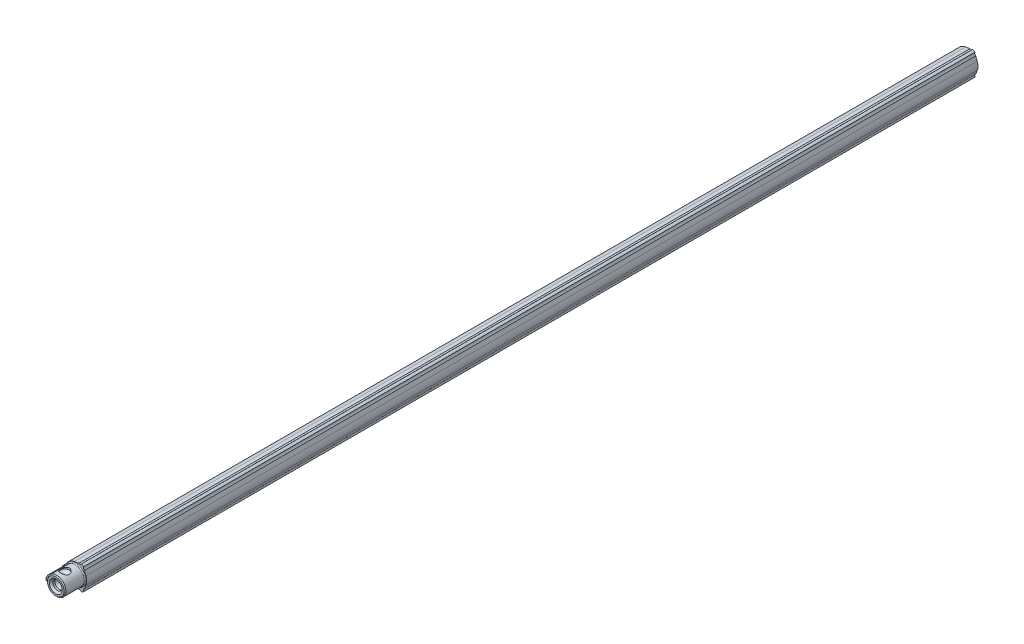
ISO-10303-21;
HEADER;
FILE_DESCRIPTION(('STEP AP214'),'2;1');
FILE_NAME('part.step','',(''),(''),'','','');
FILE_SCHEMA(('AUTOMOTIVE_DESIGN { 1 0 10303 214 1 1 1 1 }'));
ENDSEC;
DATA;
#1=APPLICATION_CONTEXT('core data for automotive mechanical design processes');
#2=APPLICATION_PROTOCOL_DEFINITION('international standard','automotive_design',2000,#1);
#3=PRODUCT_CONTEXT('',#1,'mechanical');
#4=PRODUCT('Part','Part','',(#3));
#5=PRODUCT_RELATED_PRODUCT_CATEGORY('part','',(#4));
#6=PRODUCT_DEFINITION_FORMATION('','',#4);
#7=PRODUCT_DEFINITION_CONTEXT('part definition',#1,'design');
#8=PRODUCT_DEFINITION('design','',#6,#7);
#9=PRODUCT_DEFINITION_SHAPE('','',#8);
#10=(LENGTH_UNIT() NAMED_UNIT(*) SI_UNIT(.MILLI.,.METRE.));
#11=(NAMED_UNIT(*) PLANE_ANGLE_UNIT() SI_UNIT($,.RADIAN.));
#12=(NAMED_UNIT(*) SI_UNIT($,.STERADIAN.) SOLID_ANGLE_UNIT());
#13=UNCERTAINTY_MEASURE_WITH_UNIT(LENGTH_MEASURE(1.E-05),#10,'distance_accuracy_value','');
#14=(GEOMETRIC_REPRESENTATION_CONTEXT(3) GLOBAL_UNCERTAINTY_ASSIGNED_CONTEXT((#13)) GLOBAL_UNIT_ASSIGNED_CONTEXT((#10,
#11,#12)) REPRESENTATION_CONTEXT('',''));
#15=CARTESIAN_POINT('',(0.,0.,0.));
#16=DIRECTION('',(0.,0.,1.));
#17=DIRECTION('',(1.,0.,0.));
#18=AXIS2_PLACEMENT_3D('',#15,#16,#17);
#19=CARTESIAN_POINT('',(5.42402554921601,-2.19144857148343,515.004024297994));
#20=DIRECTION('',(0.927183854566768,-0.374606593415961,0.));
#21=DIRECTION('',(0.374606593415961,0.927183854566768,0.));
#22=AXIS2_PLACEMENT_3D('',#19,#20,#21);
#23=PLANE('',#22);
#24=DIRECTION('',(0.,0.,-1.));
#25=VECTOR('',#24,1.);
#26=CARTESIAN_POINT('',(5.42402554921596,-2.19144857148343,515.004024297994));
#27=LINE('',#26,#25);
#28=CARTESIAN_POINT('',(5.42402554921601,-2.19144857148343,504.004024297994));
#29=VERTEX_POINT('',#28);
#30=CARTESIAN_POINT('',(5.42402554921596,-2.19144857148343,19.0040242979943));
#31=VERTEX_POINT('',#30);
#32=EDGE_CURVE('P0_E330',#29,#31,#27,.T.);
#33=ORIENTED_EDGE('',*,*,#32,.F.);
#34=DIRECTION('',(-0.374606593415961,-0.927183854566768,0.));
#35=VECTOR('',#34,1.);
#36=CARTESIAN_POINT('',(5.42402554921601,-2.19144857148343,504.004024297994));
#37=LINE('',#36,#35);
#38=CARTESIAN_POINT('',(4.5701069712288,-4.30497121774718,504.004024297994));
#39=VERTEX_POINT('',#38);
#40=EDGE_CURVE('P0_E229',#29,#39,#37,.T.);
#41=ORIENTED_EDGE('',*,*,#40,.T.);
#42=DIRECTION('',(0.,0.,-1.));
#43=VECTOR('',#42,1.);
#44=CARTESIAN_POINT('',(4.5701069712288,-4.30497121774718,515.004024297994));
#45=LINE('',#44,#43);
#46=CARTESIAN_POINT('',(4.5701069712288,-4.30497121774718,19.0040242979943));
#47=VERTEX_POINT('',#46);
#48=EDGE_CURVE('P0_E329',#39,#47,#45,.T.);
#49=ORIENTED_EDGE('',*,*,#48,.T.);
#50=DIRECTION('',(0.374606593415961,0.927183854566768,0.));
#51=VECTOR('',#50,1.);
#52=CARTESIAN_POINT('',(5.42402554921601,-2.19144857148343,19.0040242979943));
#53=LINE('',#52,#51);
#54=EDGE_CURVE('P0_E326',#47,#31,#53,.T.);
#55=ORIENTED_EDGE('',*,*,#54,.T.);
#56=EDGE_LOOP('',(#33,#41,#49,#55));
#57=FACE_BOUND('',#56,.T.);
#58=ADVANCED_FACE('P0_F16',(#57),#23,.T.);
#59=CARTESIAN_POINT('',(2.17217646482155E-13,-3.92053547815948E-13,515.004024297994));
#60=DIRECTION('',(0.,0.,-1.));
#61=DIRECTION('',(0.,-1.,0.));
#62=AXIS2_PLACEMENT_3D('',#59,#60,#61);
#63=CYLINDRICAL_SURFACE('',#62,5.85000000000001);
#64=DIRECTION('',(0.,0.,-1.));
#65=VECTOR('',#64,1.);
#66=CARTESIAN_POINT('',(5.42402540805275,2.19144892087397,515.004024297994));
#67=LINE('',#66,#65);
#68=CARTESIAN_POINT('',(5.4240254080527,2.19144892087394,504.004024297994));
#69=VERTEX_POINT('',#68);
#70=CARTESIAN_POINT('',(5.42402540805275,2.19144892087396,19.0040242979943));
#71=VERTEX_POINT('',#70);
#72=EDGE_CURVE('P0_E333',#69,#71,#67,.T.);
#73=ORIENTED_EDGE('',*,*,#72,.F.);
#74=CARTESIAN_POINT('',(2.17217646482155E-13,-3.92099650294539E-13,504.004024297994));
#75=DIRECTION('',(0.,0.,1.));
#76=DIRECTION('',(0.,1.,0.));
#77=AXIS2_PLACEMENT_3D('',#74,#75,#76);
#78=CIRCLE('',#77,5.85000000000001);
#79=EDGE_CURVE('P0_E233',#69,#29,#78,.F.);
#80=ORIENTED_EDGE('',*,*,#79,.T.);
#81=ORIENTED_EDGE('',*,*,#32,.T.);
#82=CARTESIAN_POINT('',(2.17217646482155E-13,-3.94132350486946E-13,19.0040242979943));
#83=DIRECTION('',(0.,0.,-1.));
#84=DIRECTION('',(0.,-1.,0.));
#85=AXIS2_PLACEMENT_3D('',#82,#83,#84);
#86=CIRCLE('',#85,5.85000000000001);
#87=EDGE_CURVE('P0_E323',#31,#71,#86,.F.);
#88=ORIENTED_EDGE('',*,*,#87,.T.);
#89=EDGE_LOOP('',(#73,#80,#81,#88));
#90=FACE_BOUND('',#89,.T.);
#91=ADVANCED_FACE('P0_F452',(#90),#63,.T.);
#92=CARTESIAN_POINT('',(4.57010661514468,4.30497148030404,515.004024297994));
#93=DIRECTION('',(0.927183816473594,0.37460668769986,0.));
#94=DIRECTION('',(-0.37460668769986,0.927183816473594,0.));
#95=AXIS2_PLACEMENT_3D('',#92,#93,#94);
#96=PLANE('',#95);
#97=DIRECTION('',(0.,0.,-1.));
#98=VECTOR('',#97,1.);
#99=CARTESIAN_POINT('',(4.57010661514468,4.30497148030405,515.004024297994));
#100=LINE('',#99,#98);
#101=CARTESIAN_POINT('',(4.57010661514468,4.30497148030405,504.004024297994));
#102=VERTEX_POINT('',#101);
#103=CARTESIAN_POINT('',(4.57010661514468,4.30497148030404,19.0040242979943));
#104=VERTEX_POINT('',#103);
#105=EDGE_CURVE('P0_E335',#102,#104,#100,.T.);
#106=ORIENTED_EDGE('',*,*,#105,.F.);
#107=DIRECTION('',(0.37460668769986,-0.927183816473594,0.));
#108=VECTOR('',#107,1.);
#109=CARTESIAN_POINT('',(4.57010661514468,4.30497148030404,504.004024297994));
#110=LINE('',#109,#108);
#111=EDGE_CURVE('P0_E236',#102,#69,#110,.T.);
#112=ORIENTED_EDGE('',*,*,#111,.T.);
#113=ORIENTED_EDGE('',*,*,#72,.T.);
#114=DIRECTION('',(-0.37460668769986,0.927183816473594,0.));
#115=VECTOR('',#114,1.);
#116=CARTESIAN_POINT('',(4.57010661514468,4.30497148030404,19.0040242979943));
#117=LINE('',#116,#115);
#118=EDGE_CURVE('P0_E320',#71,#104,#117,.T.);
#119=ORIENTED_EDGE('',*,*,#118,.T.);
#120=EDGE_LOOP('',(#106,#112,#113,#119));
#121=FACE_BOUND('',#120,.T.);
#122=ADVANCED_FACE('P0_F458',(#121),#96,.T.);
#123=CARTESIAN_POINT('',(5.30600000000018,5.30299999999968,515.004024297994));
#124=DIRECTION('',(0.,0.,-1.));
#125=DIRECTION('',(0.,-1.,0.));
#126=AXIS2_PLACEMENT_3D('',#123,#124,#125);
#127=CYLINDRICAL_SURFACE('',#126,1.23999999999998);
#128=DIRECTION('',(0.,0.,-1.));
#129=VECTOR('',#128,1.);
#130=CARTESIAN_POINT('',(4.21754201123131,5.89701953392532,515.004024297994));
#131=LINE('',#130,#129);
#132=CARTESIAN_POINT('',(4.2175420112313,5.89701953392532,504.004024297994));
#133=VERTEX_POINT('',#132);
#134=CARTESIAN_POINT('',(4.2175420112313,5.89701953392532,19.0040242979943));
#135=VERTEX_POINT('',#134);
#136=EDGE_CURVE('P0_E337',#133,#135,#131,.T.);
#137=ORIENTED_EDGE('',*,*,#136,.F.);
#138=CARTESIAN_POINT('',(5.30600000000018,5.30299999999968,504.004024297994));
#139=DIRECTION('',(0.,0.,1.));
#140=DIRECTION('',(0.,1.,0.));
#141=AXIS2_PLACEMENT_3D('',#138,#139,#140);
#142=CIRCLE('',#141,1.23999999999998);
#143=EDGE_CURVE('P0_E239',#133,#102,#142,.T.);
#144=ORIENTED_EDGE('',*,*,#143,.T.);
#145=ORIENTED_EDGE('',*,*,#105,.T.);
#146=CARTESIAN_POINT('',(5.30600000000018,5.30299999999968,19.0040242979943));
#147=DIRECTION('',(0.,0.,-1.));
#148=DIRECTION('',(0.,-1.,0.));
#149=AXIS2_PLACEMENT_3D('',#146,#147,#148);
#150=CIRCLE('',#149,1.23999999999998);
#151=EDGE_CURVE('P0_E317',#104,#135,#150,.T.);
#152=ORIENTED_EDGE('',*,*,#151,.T.);
#153=EDGE_LOOP('',(#137,#144,#145,#152));
#154=FACE_BOUND('',#153,.T.);
#155=ADVANCED_FACE('P0_F497',(#154),#127,.F.);
#156=CARTESIAN_POINT('',(2.17217646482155E-13,-3.92053547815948E-13,515.004024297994));
#157=DIRECTION('',(0.,0.,-1.));
#158=DIRECTION('',(0.,-1.,0.));
#159=AXIS2_PLACEMENT_3D('',#156,#157,#158);
#160=CYLINDRICAL_SURFACE('',#159,7.25000000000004);
#161=DIRECTION('',(0.,0.,-1.));
#162=VECTOR('',#161,1.);
#163=CARTESIAN_POINT('',(2.99819771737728,6.60100829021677,515.004024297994));
#164=LINE('',#163,#162);
#165=CARTESIAN_POINT('',(2.99819771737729,6.60100829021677,504.004024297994));
#166=VERTEX_POINT('',#165);
#167=CARTESIAN_POINT('',(2.99819771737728,6.60100829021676,19.0040242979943));
#168=VERTEX_POINT('',#167);
#169=EDGE_CURVE('P0_E339',#166,#168,#164,.T.);
#170=ORIENTED_EDGE('',*,*,#169,.F.);
#171=CARTESIAN_POINT('',(1.77217646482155E-13,-3.22277030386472E-13,504.004024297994));
#172=DIRECTION('',(0.,0.,1.));
#173=DIRECTION('',(0.,1.,0.));
#174=AXIS2_PLACEMENT_3D('',#171,#172,#173);
#175=CIRCLE('',#174,7.25);
#176=EDGE_CURVE('P0_E218',#133,#166,#175,.T.);
#177=ORIENTED_EDGE('',*,*,#176,.F.);
#178=ORIENTED_EDGE('',*,*,#136,.T.);
#179=CARTESIAN_POINT('',(2.17217646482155E-13,-3.94132350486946E-13,19.0040242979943));
#180=DIRECTION('',(0.,0.,-1.));
#181=DIRECTION('',(0.,-1.,0.));
#182=AXIS2_PLACEMENT_3D('',#179,#180,#181);
#183=CIRCLE('',#182,7.25000000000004);
#184=EDGE_CURVE('P0_E314',#135,#168,#183,.F.);
#185=ORIENTED_EDGE('',*,*,#184,.T.);
#186=EDGE_LOOP('',(#170,#177,#178,#185));
#187=FACE_BOUND('',#186,.T.);
#188=ADVANCED_FACE('P0_F501',(#187),#160,.T.);
#189=CARTESIAN_POINT('',(1.93953271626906,7.24663079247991,515.004024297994));
#190=DIRECTION('',(0.,0.,-1.));
#191=DIRECTION('',(0.,-1.,0.));
#192=AXIS2_PLACEMENT_3D('',#189,#190,#191);
#193=CYLINDRICAL_SURFACE('',#192,1.24);
#194=DIRECTION('',(0.,0.,-1.));
#195=VECTOR('',#194,1.);
#196=CARTESIAN_POINT('',(1.44316095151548,6.11031434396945,515.004024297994));
#197=LINE('',#196,#195);
#198=CARTESIAN_POINT('',(1.44316095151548,6.11031434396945,504.004024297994));
#199=VERTEX_POINT('',#198);
#200=CARTESIAN_POINT('',(1.44316095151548,6.11031434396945,19.0040242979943));
#201=VERTEX_POINT('',#200);
#202=EDGE_CURVE('P0_E341',#199,#201,#197,.T.);
#203=ORIENTED_EDGE('',*,*,#202,.F.);
#204=CARTESIAN_POINT('',(1.93953271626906,7.24663079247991,504.004024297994));
#205=DIRECTION('',(0.,0.,1.));
#206=DIRECTION('',(0.,1.,0.));
#207=AXIS2_PLACEMENT_3D('',#204,#205,#206);
#208=CIRCLE('',#207,1.24);
#209=EDGE_CURVE('P0_E269',#199,#166,#208,.T.);
#210=ORIENTED_EDGE('',*,*,#209,.T.);
#211=ORIENTED_EDGE('',*,*,#169,.T.);
#212=CARTESIAN_POINT('',(1.93953271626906,7.24663079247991,19.0040242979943));
#213=DIRECTION('',(0.,0.,-1.));
#214=DIRECTION('',(0.,-1.,0.));
#215=AXIS2_PLACEMENT_3D('',#212,#213,#214);
#216=CIRCLE('',#215,1.24);
#217=EDGE_CURVE('P0_E311',#168,#201,#216,.T.);
#218=ORIENTED_EDGE('',*,*,#217,.T.);
#219=EDGE_LOOP('',(#203,#210,#211,#218));
#220=FACE_BOUND('',#219,.T.);
#221=ADVANCED_FACE('P0_F505',(#220),#193,.F.);
#222=CARTESIAN_POINT('',(-0.814162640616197,5.79306820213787,515.004024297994));
#223=DIRECTION('',(-0.139173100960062,0.990268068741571,0.));
#224=DIRECTION('',(-0.990268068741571,-0.139173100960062,0.));
#225=AXIS2_PLACEMENT_3D('',#222,#223,#224);
#226=PLANE('',#225);
#227=DIRECTION('',(0.,0.,-1.));
#228=VECTOR('',#227,1.);
#229=CARTESIAN_POINT('',(-0.814162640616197,5.79306820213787,515.004024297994));
#230=LINE('',#229,#228);
#231=CARTESIAN_POINT('',(-0.814162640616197,5.79306820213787,504.004024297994));
#232=VERTEX_POINT('',#231);
#233=CARTESIAN_POINT('',(-0.814162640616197,5.79306820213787,19.0040242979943));
#234=VERTEX_POINT('',#233);
#235=EDGE_CURVE('P0_E343',#232,#234,#230,.T.);
#236=ORIENTED_EDGE('',*,*,#235,.F.);
#237=DIRECTION('',(0.990268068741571,0.139173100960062,0.));
#238=VECTOR('',#237,1.);
#239=CARTESIAN_POINT('',(-0.814162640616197,5.79306820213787,504.004024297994));
#240=LINE('',#239,#238);
#241=EDGE_CURVE('P0_E266',#232,#199,#240,.T.);
#242=ORIENTED_EDGE('',*,*,#241,.T.);
#243=ORIENTED_EDGE('',*,*,#202,.T.);
#244=DIRECTION('',(-0.990268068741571,-0.139173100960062,0.));
#245=VECTOR('',#244,1.);
#246=CARTESIAN_POINT('',(-0.814162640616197,5.79306820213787,19.0040242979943));
#247=LINE('',#246,#245);
#248=EDGE_CURVE('P0_E308',#201,#234,#247,.T.);
#249=ORIENTED_EDGE('',*,*,#248,.T.);
#250=EDGE_LOOP('',(#236,#242,#243,#249));
#251=FACE_BOUND('',#250,.T.);
#252=ADVANCED_FACE('P0_F509',(#251),#226,.T.);
#253=CARTESIAN_POINT('',(2.17217646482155E-13,-3.92053547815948E-13,515.004024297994));
#254=DIRECTION('',(0.,0.,-1.));
#255=DIRECTION('',(0.,-1.,0.));
#256=AXIS2_PLACEMENT_3D('',#253,#254,#255);
#257=CYLINDRICAL_SURFACE('',#256,5.85000000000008);
#258=DIRECTION('',(0.,0.,-1.));
#259=VECTOR('',#258,1.);
#260=CARTESIAN_POINT('',(-4.60986310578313,3.60161937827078,515.004024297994));
#261=LINE('',#260,#259);
#262=CARTESIAN_POINT('',(-4.60986310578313,3.60161937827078,504.004024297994));
#263=VERTEX_POINT('',#262);
#264=CARTESIAN_POINT('',(-4.60986310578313,3.60161937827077,19.0040242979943));
#265=VERTEX_POINT('',#264);
#266=EDGE_CURVE('P0_E345',#263,#265,#261,.T.);
#267=ORIENTED_EDGE('',*,*,#266,.F.);
#268=CARTESIAN_POINT('',(2.17217646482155E-13,-3.92099650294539E-13,504.004024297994));
#269=DIRECTION('',(0.,0.,1.));
#270=DIRECTION('',(0.,1.,0.));
#271=AXIS2_PLACEMENT_3D('',#268,#269,#270);
#272=CIRCLE('',#271,5.85000000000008);
#273=EDGE_CURVE('P0_E263',#263,#232,#272,.F.);
#274=ORIENTED_EDGE('',*,*,#273,.T.);
#275=ORIENTED_EDGE('',*,*,#235,.T.);
#276=CARTESIAN_POINT('',(2.17217646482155E-13,-3.94132350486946E-13,19.0040242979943));
#277=DIRECTION('',(0.,0.,-1.));
#278=DIRECTION('',(0.,-1.,0.));
#279=AXIS2_PLACEMENT_3D('',#276,#277,#278);
#280=CIRCLE('',#279,5.85000000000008);
#281=EDGE_CURVE('P0_E305',#234,#265,#280,.F.);
#282=ORIENTED_EDGE('',*,*,#281,.T.);
#283=EDGE_LOOP('',(#267,#274,#275,#282));
#284=FACE_BOUND('',#283,.T.);
#285=ADVANCED_FACE('P0_F513',(#284),#257,.T.);
#286=CARTESIAN_POINT('',(-6.01326796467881,1.80534275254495,515.004024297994));
#287=DIRECTION('',(-0.788010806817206,0.615661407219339,0.));
#288=DIRECTION('',(-0.615661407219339,-0.788010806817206,0.));
#289=AXIS2_PLACEMENT_3D('',#286,#287,#288);
#290=PLANE('',#289);
#291=DIRECTION('',(0.,0.,-1.));
#292=VECTOR('',#291,1.);
#293=CARTESIAN_POINT('',(-6.01326796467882,1.80534275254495,515.004024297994));
#294=LINE('',#293,#292);
#295=CARTESIAN_POINT('',(-6.01326796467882,1.80534275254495,504.004024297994));
#296=VERTEX_POINT('',#295);
#297=CARTESIAN_POINT('',(-6.01326796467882,1.80534275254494,19.0040242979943));
#298=VERTEX_POINT('',#297);
#299=EDGE_CURVE('P0_E347',#296,#298,#294,.T.);
#300=ORIENTED_EDGE('',*,*,#299,.F.);
#301=DIRECTION('',(0.615661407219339,0.788010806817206,0.));
#302=VECTOR('',#301,1.);
#303=CARTESIAN_POINT('',(-6.01326796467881,1.80534275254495,504.004024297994));
#304=LINE('',#303,#302);
#305=EDGE_CURVE('P0_E260',#296,#263,#304,.T.);
#306=ORIENTED_EDGE('',*,*,#305,.T.);
#307=ORIENTED_EDGE('',*,*,#266,.T.);
#308=DIRECTION('',(-0.615661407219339,-0.788010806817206,0.));
#309=VECTOR('',#308,1.);
#310=CARTESIAN_POINT('',(-6.01326796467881,1.80534275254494,19.0040242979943));
#311=LINE('',#310,#309);
#312=EDGE_CURVE('P0_E302',#265,#298,#311,.T.);
#313=ORIENTED_EDGE('',*,*,#312,.T.);
#314=EDGE_LOOP('',(#300,#306,#307,#313));
#315=FACE_BOUND('',#314,.T.);
#316=ADVANCED_FACE('P0_F517',(#315),#290,.T.);
#317=CARTESIAN_POINT('',(-7.2455327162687,1.94363079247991,515.004024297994));
#318=DIRECTION('',(0.,0.,-1.));
#319=DIRECTION('',(0.,-1.,0.));
#320=AXIS2_PLACEMENT_3D('',#317,#318,#319);
#321=CYLINDRICAL_SURFACE('',#320,1.23999999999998);
#322=DIRECTION('',(0.,0.,-1.));
#323=VECTOR('',#322,1.);
#324=CARTESIAN_POINT('',(-7.21573972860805,0.703988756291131,515.004024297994));
#325=LINE('',#324,#323);
#326=CARTESIAN_POINT('',(-7.21573972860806,0.703988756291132,504.004024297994));
#327=VERTEX_POINT('',#326);
#328=CARTESIAN_POINT('',(-7.21573972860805,0.703988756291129,19.0040242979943));
#329=VERTEX_POINT('',#328);
#330=EDGE_CURVE('P0_E349',#327,#329,#325,.T.);
#331=ORIENTED_EDGE('',*,*,#330,.F.);
#332=CARTESIAN_POINT('',(-7.2455327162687,1.94363079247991,504.004024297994));
#333=DIRECTION('',(0.,0.,1.));
#334=DIRECTION('',(0.,1.,0.));
#335=AXIS2_PLACEMENT_3D('',#332,#333,#334);
#336=CIRCLE('',#335,1.23999999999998);
#337=EDGE_CURVE('P0_E257',#327,#296,#336,.T.);
#338=ORIENTED_EDGE('',*,*,#337,.T.);
#339=ORIENTED_EDGE('',*,*,#299,.T.);
#340=CARTESIAN_POINT('',(-7.2455327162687,1.94363079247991,19.0040242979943));
#341=DIRECTION('',(0.,0.,-1.));
#342=DIRECTION('',(0.,-1.,0.));
#343=AXIS2_PLACEMENT_3D('',#340,#341,#342);
#344=CIRCLE('',#343,1.23999999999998);
#345=EDGE_CURVE('P0_E299',#298,#329,#344,.T.);
#346=ORIENTED_EDGE('',*,*,#345,.T.);
#347=EDGE_LOOP('',(#331,#338,#339,#346));
#348=FACE_BOUND('',#347,.T.);
#349=ADVANCED_FACE('P0_F521',(#348),#321,.F.);
#350=CARTESIAN_POINT('',(2.17217646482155E-13,-3.92053547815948E-13,515.004024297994));
#351=DIRECTION('',(0.,0.,-1.));
#352=DIRECTION('',(0.,-1.,0.));
#353=AXIS2_PLACEMENT_3D('',#350,#351,#352);
#354=CYLINDRICAL_SURFACE('',#353,7.25000000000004);
#355=DIRECTION('',(0.,0.,-1.));
#356=VECTOR('',#355,1.);
#357=CARTESIAN_POINT('',(-7.21573972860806,-0.703988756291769,515.004024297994));
#358=LINE('',#357,#356);
#359=CARTESIAN_POINT('',(-7.21573972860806,-0.703988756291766,504.004024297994));
#360=VERTEX_POINT('',#359);
#361=CARTESIAN_POINT('',(-7.21573972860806,-0.703988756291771,19.0040242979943));
#362=VERTEX_POINT('',#361);
#363=EDGE_CURVE('P0_E351',#360,#362,#358,.T.);
#364=ORIENTED_EDGE('',*,*,#363,.F.);
#365=EDGE_CURVE('P0_E227',#327,#360,#175,.T.);
#366=ORIENTED_EDGE('',*,*,#365,.F.);
#367=ORIENTED_EDGE('',*,*,#330,.T.);
#368=CARTESIAN_POINT('',(2.17217646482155E-13,-3.94132350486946E-13,19.0040242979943));
#369=DIRECTION('',(0.,0.,-1.));
#370=DIRECTION('',(0.,-1.,0.));
#371=AXIS2_PLACEMENT_3D('',#368,#369,#370);
#372=CIRCLE('',#371,7.25000000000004);
#373=EDGE_CURVE('P0_E296',#329,#362,#372,.F.);
#374=ORIENTED_EDGE('',*,*,#373,.T.);
#375=EDGE_LOOP('',(#364,#366,#367,#374));
#376=FACE_BOUND('',#375,.T.);
#377=ADVANCED_FACE('P0_F525',(#376),#354,.T.);
#378=CARTESIAN_POINT('',(-7.2455327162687,-1.94363079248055,515.004024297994));
#379=DIRECTION('',(0.,0.,-1.));
#380=DIRECTION('',(0.,-1.,0.));
#381=AXIS2_PLACEMENT_3D('',#378,#379,#380);
#382=CYLINDRICAL_SURFACE('',#381,1.24000000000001);
#383=DIRECTION('',(0.,0.,-1.));
#384=VECTOR('',#383,1.);
#385=CARTESIAN_POINT('',(-6.01326792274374,-1.80534312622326,515.004024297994));
#386=LINE('',#385,#384);
#387=CARTESIAN_POINT('',(-6.01326792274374,-1.80534312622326,504.004024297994));
#388=VERTEX_POINT('',#387);
#389=CARTESIAN_POINT('',(-6.01326792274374,-1.80534312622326,19.0040242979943));
#390=VERTEX_POINT('',#389);
#391=EDGE_CURVE('P0_E353',#388,#390,#386,.T.);
#392=ORIENTED_EDGE('',*,*,#391,.F.);
#393=CARTESIAN_POINT('',(-7.2455327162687,-1.94363079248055,504.004024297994));
#394=DIRECTION('',(0.,0.,1.));
#395=DIRECTION('',(0.,1.,0.));
#396=AXIS2_PLACEMENT_3D('',#393,#394,#395);
#397=CIRCLE('',#396,1.24000000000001);
#398=EDGE_CURVE('P0_E254',#388,#360,#397,.T.);
#399=ORIENTED_EDGE('',*,*,#398,.T.);
#400=ORIENTED_EDGE('',*,*,#363,.T.);
#401=CARTESIAN_POINT('',(-7.2455327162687,-1.94363079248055,19.0040242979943));
#402=DIRECTION('',(0.,0.,-1.));
#403=DIRECTION('',(0.,-1.,0.));
#404=AXIS2_PLACEMENT_3D('',#401,#402,#403);
#405=CIRCLE('',#404,1.24000000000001);
#406=EDGE_CURVE('P0_E293',#362,#390,#405,.T.);
#407=ORIENTED_EDGE('',*,*,#406,.T.);
#408=EDGE_LOOP('',(#392,#399,#400,#407));
#409=FACE_BOUND('',#408,.T.);
#410=ADVANCED_FACE('P0_F529',(#409),#382,.F.);
#411=CARTESIAN_POINT('',(-4.60986290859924,-3.60161963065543,515.004024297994));
#412=DIRECTION('',(-0.788010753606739,-0.615661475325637,0.));
#413=DIRECTION('',(0.615661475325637,-0.788010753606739,0.));
#414=AXIS2_PLACEMENT_3D('',#411,#412,#413);
#415=PLANE('',#414);
#416=DIRECTION('',(0.,0.,-1.));
#417=VECTOR('',#416,1.);
#418=CARTESIAN_POINT('',(-4.60986290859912,-3.60161963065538,515.004024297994));
#419=LINE('',#418,#417);
#420=CARTESIAN_POINT('',(-4.60986290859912,-3.60161963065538,504.004024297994));
#421=VERTEX_POINT('',#420);
#422=CARTESIAN_POINT('',(-4.60986290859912,-3.60161963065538,19.0040242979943));
#423=VERTEX_POINT('',#422);
#424=EDGE_CURVE('P0_E355',#421,#423,#419,.T.);
#425=ORIENTED_EDGE('',*,*,#424,.F.);
#426=DIRECTION('',(-0.615661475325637,0.788010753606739,0.));
#427=VECTOR('',#426,1.);
#428=CARTESIAN_POINT('',(-4.60986290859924,-3.60161963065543,504.004024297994));
#429=LINE('',#428,#427);
#430=EDGE_CURVE('P0_E251',#421,#388,#429,.T.);
#431=ORIENTED_EDGE('',*,*,#430,.T.);
#432=ORIENTED_EDGE('',*,*,#391,.T.);
#433=DIRECTION('',(0.615661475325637,-0.788010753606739,0.));
#434=VECTOR('',#433,1.);
#435=CARTESIAN_POINT('',(-4.60986290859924,-3.60161963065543,19.0040242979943));
#436=LINE('',#435,#434);
#437=EDGE_CURVE('P0_E290',#390,#423,#436,.T.);
#438=ORIENTED_EDGE('',*,*,#437,.T.);
#439=EDGE_LOOP('',(#425,#431,#432,#438));
#440=FACE_BOUND('',#439,.T.);
#441=ADVANCED_FACE('P0_F533',(#440),#415,.T.);
#442=CARTESIAN_POINT('',(2.17217646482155E-13,-3.92053547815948E-13,515.004024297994));
#443=DIRECTION('',(0.,0.,-1.));
#444=DIRECTION('',(0.,-1.,0.));
#445=AXIS2_PLACEMENT_3D('',#442,#443,#444);
#446=CYLINDRICAL_SURFACE('',#445,5.84999999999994);
#447=DIRECTION('',(0.,0.,-1.));
#448=VECTOR('',#447,1.);
#449=CARTESIAN_POINT('',(-0.814162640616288,-5.79306820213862,515.004024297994));
#450=LINE('',#449,#448);
#451=CARTESIAN_POINT('',(-0.814162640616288,-5.79306820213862,504.004024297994));
#452=VERTEX_POINT('',#451);
#453=CARTESIAN_POINT('',(-0.814162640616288,-5.79306820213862,19.0040242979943));
#454=VERTEX_POINT('',#453);
#455=EDGE_CURVE('P0_E357',#452,#454,#450,.T.);
#456=ORIENTED_EDGE('',*,*,#455,.F.);
#457=CARTESIAN_POINT('',(2.17217646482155E-13,-3.92099650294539E-13,504.004024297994));
#458=DIRECTION('',(0.,0.,1.));
#459=DIRECTION('',(0.,1.,0.));
#460=AXIS2_PLACEMENT_3D('',#457,#458,#459);
#461=CIRCLE('',#460,5.84999999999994);
#462=EDGE_CURVE('P0_E248',#452,#421,#461,.F.);
#463=ORIENTED_EDGE('',*,*,#462,.T.);
#464=ORIENTED_EDGE('',*,*,#424,.T.);
#465=CARTESIAN_POINT('',(2.17217646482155E-13,-3.94132350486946E-13,19.0040242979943));
#466=DIRECTION('',(0.,0.,-1.));
#467=DIRECTION('',(0.,-1.,0.));
#468=AXIS2_PLACEMENT_3D('',#465,#466,#467);
#469=CIRCLE('',#468,5.84999999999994);
#470=EDGE_CURVE('P0_E287',#423,#454,#469,.F.);
#471=ORIENTED_EDGE('',*,*,#470,.T.);
#472=EDGE_LOOP('',(#456,#463,#464,#471));
#473=FACE_BOUND('',#472,.T.);
#474=ADVANCED_FACE('P0_F537',(#473),#446,.T.);
#475=CARTESIAN_POINT('',(1.44316095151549,-6.1103143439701,515.004024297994));
#476=DIRECTION('',(-0.139173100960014,-0.990268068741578,0.));
#477=DIRECTION('',(0.990268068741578,-0.139173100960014,0.));
#478=AXIS2_PLACEMENT_3D('',#475,#476,#477);
#479=PLANE('',#478);
#480=DIRECTION('',(0.,0.,-1.));
#481=VECTOR('',#480,1.);
#482=CARTESIAN_POINT('',(1.44316095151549,-6.1103143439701,515.004024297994));
#483=LINE('',#482,#481);
#484=CARTESIAN_POINT('',(1.44316095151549,-6.1103143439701,504.004024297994));
#485=VERTEX_POINT('',#484);
#486=CARTESIAN_POINT('',(1.44316095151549,-6.1103143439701,19.0040242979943));
#487=VERTEX_POINT('',#486);
#488=EDGE_CURVE('P0_E359',#485,#487,#483,.T.);
#489=ORIENTED_EDGE('',*,*,#488,.F.);
#490=DIRECTION('',(-0.990268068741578,0.139173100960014,0.));
#491=VECTOR('',#490,1.);
#492=CARTESIAN_POINT('',(1.44316095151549,-6.1103143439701,504.004024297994));
#493=LINE('',#492,#491);
#494=EDGE_CURVE('P0_E245',#485,#452,#493,.T.);
#495=ORIENTED_EDGE('',*,*,#494,.T.);
#496=ORIENTED_EDGE('',*,*,#455,.T.);
#497=DIRECTION('',(0.990268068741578,-0.139173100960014,0.));
#498=VECTOR('',#497,1.);
#499=CARTESIAN_POINT('',(1.44316095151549,-6.1103143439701,19.0040242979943));
#500=LINE('',#499,#498);
#501=EDGE_CURVE('P0_E284',#454,#487,#500,.T.);
#502=ORIENTED_EDGE('',*,*,#501,.T.);
#503=EDGE_LOOP('',(#489,#495,#496,#502));
#504=FACE_BOUND('',#503,.T.);
#505=ADVANCED_FACE('P0_F541',(#504),#479,.T.);
#506=CARTESIAN_POINT('',(1.93953271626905,-7.24663079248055,515.004024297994));
#507=DIRECTION('',(0.,0.,-1.));
#508=DIRECTION('',(0.,-1.,0.));
#509=AXIS2_PLACEMENT_3D('',#506,#507,#508);
#510=CYLINDRICAL_SURFACE('',#509,1.23999999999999);
#511=DIRECTION('',(0.,0.,-1.));
#512=VECTOR('',#511,1.);
#513=CARTESIAN_POINT('',(2.99819771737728,-6.60100829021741,515.004024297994));
#514=LINE('',#513,#512);
#515=CARTESIAN_POINT('',(2.99819771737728,-6.60100829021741,504.004024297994));
#516=VERTEX_POINT('',#515);
#517=CARTESIAN_POINT('',(2.99819771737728,-6.60100829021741,19.0040242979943));
#518=VERTEX_POINT('',#517);
#519=EDGE_CURVE('P0_E361',#516,#518,#514,.T.);
#520=ORIENTED_EDGE('',*,*,#519,.F.);
#521=CARTESIAN_POINT('',(1.93953271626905,-7.24663079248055,504.004024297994));
#522=DIRECTION('',(0.,0.,1.));
#523=DIRECTION('',(0.,1.,0.));
#524=AXIS2_PLACEMENT_3D('',#521,#522,#523);
#525=CIRCLE('',#524,1.23999999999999);
#526=EDGE_CURVE('P0_E242',#516,#485,#525,.T.);
#527=ORIENTED_EDGE('',*,*,#526,.T.);
#528=ORIENTED_EDGE('',*,*,#488,.T.);
#529=CARTESIAN_POINT('',(1.93953271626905,-7.24663079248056,19.0040242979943));
#530=DIRECTION('',(0.,0.,-1.));
#531=DIRECTION('',(0.,-1.,0.));
#532=AXIS2_PLACEMENT_3D('',#529,#530,#531);
#533=CIRCLE('',#532,1.23999999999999);
#534=EDGE_CURVE('P0_E281',#487,#518,#533,.T.);
#535=ORIENTED_EDGE('',*,*,#534,.T.);
#536=EDGE_LOOP('',(#520,#527,#528,#535));
#537=FACE_BOUND('',#536,.T.);
#538=ADVANCED_FACE('P0_F545',(#537),#510,.F.);
#539=CARTESIAN_POINT('',(2.17217646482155E-13,-3.92053547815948E-13,515.004024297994));
#540=DIRECTION('',(0.,0.,-1.));
#541=DIRECTION('',(0.,-1.,0.));
#542=AXIS2_PLACEMENT_3D('',#539,#540,#541);
#543=CYLINDRICAL_SURFACE('',#542,7.24999999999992);
#544=DIRECTION('',(0.,0.,-1.));
#545=VECTOR('',#544,1.);
#546=CARTESIAN_POINT('',(4.21754201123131,-5.89701953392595,515.004024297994));
#547=LINE('',#546,#545);
#548=CARTESIAN_POINT('',(4.21754201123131,-5.89701953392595,504.004024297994));
#549=VERTEX_POINT('',#548);
#550=CARTESIAN_POINT('',(4.21754201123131,-5.89701953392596,19.0040242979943));
#551=VERTEX_POINT('',#550);
#552=EDGE_CURVE('P0_E363',#549,#551,#547,.T.);
#553=ORIENTED_EDGE('',*,*,#552,.F.);
#554=EDGE_CURVE('P0_E230',#516,#549,#175,.T.);
#555=ORIENTED_EDGE('',*,*,#554,.F.);
#556=ORIENTED_EDGE('',*,*,#519,.T.);
#557=CARTESIAN_POINT('',(2.17217646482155E-13,-3.94132350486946E-13,19.0040242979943));
#558=DIRECTION('',(0.,0.,-1.));
#559=DIRECTION('',(0.,-1.,0.));
#560=AXIS2_PLACEMENT_3D('',#557,#558,#559);
#561=CIRCLE('',#560,7.24999999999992);
#562=EDGE_CURVE('P0_E278',#518,#551,#561,.F.);
#563=ORIENTED_EDGE('',*,*,#562,.T.);
#564=EDGE_LOOP('',(#553,#555,#556,#563));
#565=FACE_BOUND('',#564,.T.);
#566=ADVANCED_FACE('P0_F548',(#565),#543,.T.);
#567=CARTESIAN_POINT('',(5.30600000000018,-5.30300000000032,515.004024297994));
#568=DIRECTION('',(0.,0.,-1.));
#569=DIRECTION('',(0.,-1.,0.));
#570=AXIS2_PLACEMENT_3D('',#567,#568,#569);
#571=CYLINDRICAL_SURFACE('',#570,1.24);
#572=ORIENTED_EDGE('',*,*,#48,.F.);
#573=CARTESIAN_POINT('',(5.30600000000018,-5.30300000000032,504.004024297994));
#574=DIRECTION('',(0.,0.,1.));
#575=DIRECTION('',(0.,1.,0.));
#576=AXIS2_PLACEMENT_3D('',#573,#574,#575);
#577=CIRCLE('',#576,1.24);
#578=EDGE_CURVE('P0_E368',#39,#549,#577,.T.);
#579=ORIENTED_EDGE('',*,*,#578,.T.);
#580=ORIENTED_EDGE('',*,*,#552,.T.);
#581=CARTESIAN_POINT('',(5.30600000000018,-5.30300000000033,19.0040242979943));
#582=DIRECTION('',(0.,0.,-1.));
#583=DIRECTION('',(0.,-1.,0.));
#584=AXIS2_PLACEMENT_3D('',#581,#582,#583);
#585=CIRCLE('',#584,1.24);
#586=EDGE_CURVE('P0_E332',#551,#47,#585,.T.);
#587=ORIENTED_EDGE('',*,*,#586,.T.);
#588=EDGE_LOOP('',(#572,#579,#580,#587));
#589=FACE_BOUND('',#588,.T.);
#590=ADVANCED_FACE('P0_F463',(#589),#571,.F.);
#591=CARTESIAN_POINT('',(1.77217646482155E-13,-3.24309730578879E-13,19.0040242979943));
#592=DIRECTION('',(0.,0.,-1.));
#593=DIRECTION('',(0.,-1.,0.));
#594=AXIS2_PLACEMENT_3D('',#591,#592,#593);
#595=PLANE('',#594);
#596=CARTESIAN_POINT('',(1.77217646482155E-13,-3.24309730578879E-13,19.0040242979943));
#597=DIRECTION('',(0.,0.,-1.));
#598=DIRECTION('',(0.,-1.,0.));
#599=AXIS2_PLACEMENT_3D('',#596,#597,#598);
#600=CIRCLE('',#599,1.65);
#601=CARTESIAN_POINT('',(1.77217646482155E-13,-1.65000000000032,19.0040242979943));
#602=VERTEX_POINT('',#601);
#603=EDGE_CURVE('P0_E272',#602,#602,#600,.T.);
#604=ORIENTED_EDGE('',*,*,#603,.F.);
#605=EDGE_LOOP('',(#604));
#606=FACE_BOUND('',#605,.T.);
#607=ORIENTED_EDGE('',*,*,#586,.F.);
#608=ORIENTED_EDGE('',*,*,#562,.F.);
#609=ORIENTED_EDGE('',*,*,#534,.F.);
#610=ORIENTED_EDGE('',*,*,#501,.F.);
#611=ORIENTED_EDGE('',*,*,#470,.F.);
#612=ORIENTED_EDGE('',*,*,#437,.F.);
#613=ORIENTED_EDGE('',*,*,#406,.F.);
#614=ORIENTED_EDGE('',*,*,#373,.F.);
#615=ORIENTED_EDGE('',*,*,#345,.F.);
#616=ORIENTED_EDGE('',*,*,#312,.F.);
#617=ORIENTED_EDGE('',*,*,#281,.F.);
#618=ORIENTED_EDGE('',*,*,#248,.F.);
#619=ORIENTED_EDGE('',*,*,#217,.F.);
#620=ORIENTED_EDGE('',*,*,#184,.F.);
#621=ORIENTED_EDGE('',*,*,#151,.F.);
#622=ORIENTED_EDGE('',*,*,#118,.F.);
#623=ORIENTED_EDGE('',*,*,#87,.F.);
#624=ORIENTED_EDGE('',*,*,#54,.F.);
#625=EDGE_LOOP('',(#607,#608,#609,#610,#611,#612,#613,#614,#615,#616,#617,#618,#619,#620,#621,
#622,#623,#624));
#626=FACE_BOUND('',#625,.T.);
#627=ADVANCED_FACE('P0_F487',(#606,#626),#595,.T.);
#628=CARTESIAN_POINT('',(1.77217646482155E-13,-3.24254826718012E-13,32.1040242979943));
#629=DIRECTION('',(0.,0.,-1.));
#630=DIRECTION('',(0.,-1.,0.));
#631=AXIS2_PLACEMENT_3D('',#628,#629,#630);
#632=CONICAL_SURFACE('',#631,1.65,1.02974425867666);
#633=CARTESIAN_POINT('',(1.80669048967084E-13,-3.24250671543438E-13,33.0954443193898));
#634=VERTEX_POINT('',#633);
#635=VERTEX_LOOP('',#634);
#636=FACE_BOUND('',#635,.T.);
#637=CARTESIAN_POINT('',(1.77217646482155E-13,-3.24254826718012E-13,32.1040242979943));
#638=DIRECTION('',(0.,0.,-1.));
#639=DIRECTION('',(0.,-1.,0.));
#640=AXIS2_PLACEMENT_3D('',#637,#638,#639);
#641=CIRCLE('',#640,1.65);
#642=CARTESIAN_POINT('',(1.77217646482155E-13,-1.65000000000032,32.1040242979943));
#643=VERTEX_POINT('',#642);
#644=EDGE_CURVE('P0_E275',#643,#643,#641,.T.);
#645=ORIENTED_EDGE('',*,*,#644,.T.);
#646=EDGE_LOOP('',(#645));
#647=FACE_BOUND('',#646,.T.);
#648=ADVANCED_FACE('P0_F483',(#636,#647),#632,.F.);
#649=CARTESIAN_POINT('',(1.77217646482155E-13,-3.24309730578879E-13,19.0040242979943));
#650=DIRECTION('',(0.,0.,-1.));
#651=DIRECTION('',(0.,-1.,0.));
#652=AXIS2_PLACEMENT_3D('',#649,#650,#651);
#653=CYLINDRICAL_SURFACE('',#652,1.65);
#654=ORIENTED_EDGE('',*,*,#644,.F.);
#655=EDGE_LOOP('',(#654));
#656=FACE_BOUND('',#655,.T.);
#657=ORIENTED_EDGE('',*,*,#603,.T.);
#658=EDGE_LOOP('',(#657));
#659=FACE_BOUND('',#658,.T.);
#660=ADVANCED_FACE('P0_F479',(#656,#659),#653,.F.);
#661=CARTESIAN_POINT('',(1.77217646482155E-13,-3.22277030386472E-13,504.004024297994));
#662=DIRECTION('',(0.,0.,1.));
#663=DIRECTION('',(0.,1.,0.));
#664=AXIS2_PLACEMENT_3D('',#661,#662,#663);
#665=PLANE('',#664);
#666=CARTESIAN_POINT('',(-5.30584298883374,-1.22696123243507,504.004024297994));
#667=CARTESIAN_POINT('',(-4.6837969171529,-0.86531288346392,504.004024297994));
#668=CARTESIAN_POINT('',(-4.90071946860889,-0.991428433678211,504.678390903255));
#669=CARTESIAN_POINT('',(-5.31973479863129,-1.20305033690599,504.004024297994));
#670=CARTESIAN_POINT('',(-4.70057387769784,-0.871215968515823,504.004024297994));
#671=CARTESIAN_POINT('',(-4.90320067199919,-0.979160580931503,504.667585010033));
#672=CARTESIAN_POINT('',(-5.33241353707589,-1.17847104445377,504.004024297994));
#673=CARTESIAN_POINT('',(-4.71843564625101,-0.873870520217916,504.004024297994));
#674=CARTESIAN_POINT('',(-4.90577076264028,-0.96622300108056,504.656546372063));
#675=CARTESIAN_POINT('',(-5.35554028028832,-1.12829796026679,504.004024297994));
#676=CARTESIAN_POINT('',(-4.75453102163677,-0.87315541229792,504.004024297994));
#677=CARTESIAN_POINT('',(-4.91105074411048,-0.939022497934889,504.634181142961));
#678=CARTESIAN_POINT('',(-5.36598965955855,-1.1027048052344,504.004024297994));
#679=CARTESIAN_POINT('',(-4.772763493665,-0.869971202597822,504.004024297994));
#680=CARTESIAN_POINT('',(-4.91376054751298,-0.924760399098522,504.622854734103));
#681=CARTESIAN_POINT('',(-5.38475763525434,-1.05110426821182,504.004024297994));
#682=CARTESIAN_POINT('',(-4.80835358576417,-0.85856324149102,504.004024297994));
#683=CARTESIAN_POINT('',(-4.9192523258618,-0.895087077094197,504.600212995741));
#684=CARTESIAN_POINT('',(-5.39310006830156,-1.02510541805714,504.004024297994));
#685=CARTESIAN_POINT('',(-4.82574737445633,-0.850536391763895,504.004024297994));
#686=CARTESIAN_POINT('',(-4.92203306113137,-0.879691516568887,504.588899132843));
#687=CARTESIAN_POINT('',(-5.40801439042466,-0.972638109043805,504.004024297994));
#688=CARTESIAN_POINT('',(-4.85934395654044,-0.830357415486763,504.004024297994));
#689=CARTESIAN_POINT('',(-4.92766039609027,-0.847598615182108,504.566299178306));
#690=CARTESIAN_POINT('',(-5.41458798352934,-0.946170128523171,504.004024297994));
#691=CARTESIAN_POINT('',(-4.87559561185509,-0.818305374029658,504.004024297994));
#692=CARTESIAN_POINT('',(-4.93050692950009,-0.830902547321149,504.555013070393));
#693=CARTESIAN_POINT('',(-5.43371133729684,-0.858309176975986,504.004024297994));
#694=CARTESIAN_POINT('',(-4.92588769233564,-0.773634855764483,504.004024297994));
#695=CARTESIAN_POINT('',(-4.93994799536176,-0.773651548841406,504.518055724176));
#696=CARTESIAN_POINT('',(-5.4429383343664,-0.796190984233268,504.004024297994));
#697=CARTESIAN_POINT('',(-4.95791457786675,-0.733541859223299,504.004024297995));
#698=CARTESIAN_POINT('',(-4.94661006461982,-0.730265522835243,504.492733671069));
#699=CARTESIAN_POINT('',(-5.45562299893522,-0.671341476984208,504.004024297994));
#700=CARTESIAN_POINT('',(-5.01245602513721,-0.641894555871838,504.004024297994));
#701=CARTESIAN_POINT('',(-4.95955142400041,-0.636470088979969,504.444727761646));
#702=CARTESIAN_POINT('',(-5.45906807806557,-0.60860912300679,504.004024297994));
#703=CARTESIAN_POINT('',(-5.03557722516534,-0.590446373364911,504.004024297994));
#704=CARTESIAN_POINT('',(-4.96582985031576,-0.58604561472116,504.422049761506));
#705=CARTESIAN_POINT('',(-5.46255104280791,-0.482616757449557,504.004024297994));
#706=CARTESIAN_POINT('',(-5.07336235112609,-0.480243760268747,504.004024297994));
#707=CARTESIAN_POINT('',(-4.97737599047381,-0.47818109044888,504.381112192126));
#708=CARTESIAN_POINT('',(-5.46256340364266,-0.419356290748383,504.004024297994));
#709=CARTESIAN_POINT('',(-5.08842686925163,-0.421150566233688,504.004024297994));
#710=CARTESIAN_POINT('',(-4.98263584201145,-0.420691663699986,504.362886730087));
#711=CARTESIAN_POINT('',(-5.46142596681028,-0.292919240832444,504.004024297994));
#712=CARTESIAN_POINT('',(-5.11126117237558,-0.299071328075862,504.004024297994));
#713=CARTESIAN_POINT('',(-4.99134169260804,-0.300189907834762,504.333066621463));
#714=CARTESIAN_POINT('',(-5.46027723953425,-0.229742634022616,504.004024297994));
#715=CARTESIAN_POINT('',(-5.11932055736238,-0.235530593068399,504.004024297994));
#716=CARTESIAN_POINT('',(-4.99478935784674,-0.237182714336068,504.321465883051));
#717=CARTESIAN_POINT('',(-5.45862177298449,-0.102056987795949,504.004024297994));
#718=CARTESIAN_POINT('',(-5.12947476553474,-0.10572771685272,504.004024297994));
#719=CARTESIAN_POINT('',(-4.99929356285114,-0.106691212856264,504.306359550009));
#720=CARTESIAN_POINT('',(-5.45812892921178,-0.0375476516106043,504.004024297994));
#721=CARTESIAN_POINT('',(-5.13157453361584,-0.0386262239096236,504.004024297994));
#722=CARTESIAN_POINT('',(-5.00029870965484,-0.0391409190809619,504.303027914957));
#723=CARTESIAN_POINT('',(-5.45845507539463,0.0914971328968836,504.004024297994));
#724=CARTESIAN_POINT('',(-5.12994467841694,0.0943686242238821,504.004024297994));
#725=CARTESIAN_POINT('',(-4.99954274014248,0.0954318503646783,504.305549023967));
#726=CARTESIAN_POINT('',(-5.45927468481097,0.156032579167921,504.004024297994));
#727=CARTESIAN_POINT('',(-5.12619101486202,0.16113319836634,504.004024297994));
#728=CARTESIAN_POINT('',(-4.99778031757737,0.162454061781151,504.311406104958));
#729=CARTESIAN_POINT('',(-5.46115158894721,0.284855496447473,504.004024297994));
#730=CARTESIAN_POINT('',(-5.11243411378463,0.290715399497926,504.004024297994));
#731=CARTESIAN_POINT('',(-4.99187958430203,0.292110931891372,504.331283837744));
#732=CARTESIAN_POINT('',(-5.46220799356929,0.349143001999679,504.004024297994));
#733=CARTESIAN_POINT('',(-5.10227602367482,0.354300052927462,504.004024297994));
#734=CARTESIAN_POINT('',(-4.9877500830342,0.354760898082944,504.34527422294));
#735=CARTESIAN_POINT('',(-5.46242898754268,0.477712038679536,504.004024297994));
#736=CARTESIAN_POINT('',(-5.07468463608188,0.475479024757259,504.004024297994));
#737=CARTESIAN_POINT('',(-4.97785945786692,0.473774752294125,504.379466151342));
#738=CARTESIAN_POINT('',(-5.46159485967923,0.541993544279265,504.004024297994));
#739=CARTESIAN_POINT('',(-5.05690380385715,0.533585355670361,504.004024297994));
#740=CARTESIAN_POINT('',(-4.97209944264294,0.530142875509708,504.399663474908));
#741=CARTESIAN_POINT('',(-5.45732428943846,0.632574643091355,504.004024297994));
#742=CARTESIAN_POINT('',(-5.02628317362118,0.608468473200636,504.004024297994));
#743=CARTESIAN_POINT('',(-4.96334954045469,0.604672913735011,504.431097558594));
#744=CARTESIAN_POINT('',(-5.4557091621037,0.658953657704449,504.004024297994));
#745=CARTESIAN_POINT('',(-5.01649418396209,0.629803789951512,504.004024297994));
#746=CARTESIAN_POINT('',(-4.96072539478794,0.625789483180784,504.440608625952));
#747=CARTESIAN_POINT('',(-5.45156214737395,0.711648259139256,504.004024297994));
#748=CARTESIAN_POINT('',(-4.99542381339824,0.670714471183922,504.004024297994));
#749=CARTESIAN_POINT('',(-4.95537759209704,0.666812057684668,504.460195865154));
#750=CARTESIAN_POINT('',(-5.44903000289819,0.737963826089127,504.004024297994));
#751=CARTESIAN_POINT('',(-4.9840992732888,0.690288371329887,504.004024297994));
#752=CARTESIAN_POINT('',(-4.95265390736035,0.686717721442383,504.470272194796));
#753=CARTESIAN_POINT('',(-5.44289765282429,0.790213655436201,504.004024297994));
#754=CARTESIAN_POINT('',(-4.96006791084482,0.727109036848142,504.004024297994));
#755=CARTESIAN_POINT('',(-4.94718182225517,0.72509230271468,504.490741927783));
#756=CARTESIAN_POINT('',(-5.43930816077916,0.816149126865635,504.004024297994));
#757=CARTESIAN_POINT('',(-4.9473274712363,0.744363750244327,504.004024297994));
#758=CARTESIAN_POINT('',(-4.94443392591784,0.743573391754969,504.501131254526));
#759=CARTESIAN_POINT('',(-5.43087629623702,0.867813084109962,504.004024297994));
#760=CARTESIAN_POINT('',(-4.92043183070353,0.776376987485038,504.004024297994));
#761=CARTESIAN_POINT('',(-4.93892496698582,0.779324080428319,504.522196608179));
#762=CARTESIAN_POINT('',(-5.42603377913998,0.893541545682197,504.004024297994));
#763=CARTESIAN_POINT('',(-4.90622821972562,0.791101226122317,504.004024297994));
#764=CARTESIAN_POINT('',(-4.93616390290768,0.796593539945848,504.532872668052));
#765=CARTESIAN_POINT('',(-5.40933454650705,0.970389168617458,504.004024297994));
#766=CARTESIAN_POINT('',(-4.86098573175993,0.831251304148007,504.004024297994));
#767=CARTESIAN_POINT('',(-4.92790987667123,0.846659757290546,504.565183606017));
#768=CARTESIAN_POINT('',(-5.39531411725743,1.02109299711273,504.004024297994));
#769=CARTESIAN_POINT('',(-4.82809309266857,0.85130403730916,504.004024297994));
#770=CARTESIAN_POINT('',(-4.92245438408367,0.877657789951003,504.587070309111));
#771=CARTESIAN_POINT('',(-5.3596434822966,1.12102717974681,504.004024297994));
#772=CARTESIAN_POINT('',(-4.75961356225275,0.875098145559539,504.004024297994));
#773=CARTESIAN_POINT('',(-4.9117922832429,0.935493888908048,504.630909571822));
#774=CARTESIAN_POINT('',(-5.33782288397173,1.17019554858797,504.004024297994));
#775=CARTESIAN_POINT('',(-4.72378489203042,0.877454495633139,504.004024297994));
#776=CARTESIAN_POINT('',(-4.90659445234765,0.962218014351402,504.652851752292));
#777=CARTESIAN_POINT('',(-5.31144348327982,1.21717482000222,504.004024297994));
#778=CARTESIAN_POINT('',(-4.69077958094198,0.867568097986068,504.004024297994));
#779=CARTESIAN_POINT('',(-4.9017370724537,0.986395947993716,504.673968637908));
#780=(BOUNDED_SURFACE() B_SPLINE_SURFACE(3,2,((#666,#667,#668),(#669,#670,#671),(#672,#673,
#674),(#675,#676,#677),(#678,#679,#680),(#681,#682,#683),(#684,#685,#686),(#687,#688,#689),
(#690,#691,#692),(#693,#694,#695),(#696,#697,#698),(#699,#700,#701),(#702,#703,#704),(#705,#706,
#707),(#708,#709,#710),(#711,#712,#713),(#714,#715,#716),(#717,#718,#719),(#720,#721,#722),
(#723,#724,#725),(#726,#727,#728),(#729,#730,#731),(#732,#733,#734),(#735,#736,#737),(#738,#739,
#740),(#741,#742,#743),(#744,#745,#746),(#747,#748,#749),(#750,#751,#752),(#753,#754,#755),
(#756,#757,#758),(#759,#760,#761),(#762,#763,#764),(#765,#766,#767),(#768,#769,#770),(#771,#772,
#773),(#774,#775,#776),(#777,#778,#779)),.UNSPECIFIED.,.F.,.F.,
.F.) B_SPLINE_SURFACE_WITH_KNOTS((4,2,2,2,2,2,2,2,2,2,2,2,2,2,2,2,2,2,4),(3,3),(0.,
0.0828803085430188,0.1657093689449,0.24755452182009,0.329320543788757,0.517252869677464,
0.705593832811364,0.895335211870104,1.08490183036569,1.27842384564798,1.47203722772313,
1.66493468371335,1.85770129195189,1.93697271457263,2.01626637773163,2.0947827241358,
2.17330813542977,2.33059196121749,2.49154569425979),(0.,1.),
.UNSPECIFIED.) GEOMETRIC_REPRESENTATION_ITEM() RATIONAL_B_SPLINE_SURFACE(((1.,0.570644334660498,
1.),(1.,0.580115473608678,1.),(1.,0.589547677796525,1.),(1.,0.608217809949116,1.),(1.,
0.617455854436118,1.),(1.,0.63552528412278,1.),(1.,0.644360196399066,1.),(1.,0.661664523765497,
1.),(1.,0.670134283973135,1.),(1.,0.697372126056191,1.),(1.,0.715232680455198,1.),(1.,
0.748042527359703,1.),(1.,0.762985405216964,1.),(1.,0.78935904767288,1.),(1.,0.800762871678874,
1.),(1.,0.819172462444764,1.),(1.,0.826182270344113,1.),(1.,0.835276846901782,1.),(1.,
0.837255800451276,1.),(1.,0.835748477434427,1.),(1.,0.832259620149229,1.),(1.,0.820228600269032,
1.),(1.,0.811705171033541,1.),(1.,0.790361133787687,1.),(1.,0.777543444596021,1.),(1.,
0.756942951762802,1.),(1.,0.750639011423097,1.),(1.,0.737476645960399,1.),(1.,0.730618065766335,
1.),(1.,0.716471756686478,1.),(1.,0.709188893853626,1.),(1.,0.694179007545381,1.),(1.,
0.686451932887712,1.),(1.,0.662638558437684,1.),(1.,0.645941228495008,1.),(1.,0.611094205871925,
1.),(1.,0.592919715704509,1.),(1.,0.574504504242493,1.))) REPRESENTATION_ITEM('') SURFACE());
#781=CARTESIAN_POINT('',(-5.30584298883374,-1.22696123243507,504.004024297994));
#782=CARTESIAN_POINT('',(-5.31973479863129,-1.20305033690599,504.004024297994));
#783=CARTESIAN_POINT('',(-5.33241353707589,-1.17847104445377,504.004024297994));
#784=CARTESIAN_POINT('',(-5.35554028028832,-1.12829796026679,504.004024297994));
#785=CARTESIAN_POINT('',(-5.36598965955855,-1.1027048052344,504.004024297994));
#786=CARTESIAN_POINT('',(-5.38475763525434,-1.05110426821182,504.004024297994));
#787=CARTESIAN_POINT('',(-5.39310006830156,-1.02510541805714,504.004024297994));
#788=CARTESIAN_POINT('',(-5.40801439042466,-0.972638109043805,504.004024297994));
#789=CARTESIAN_POINT('',(-5.41458798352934,-0.946170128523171,504.004024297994));
#790=CARTESIAN_POINT('',(-5.43371133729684,-0.858309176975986,504.004024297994));
#791=CARTESIAN_POINT('',(-5.4429383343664,-0.796190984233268,504.004024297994));
#792=CARTESIAN_POINT('',(-5.45562299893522,-0.671341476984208,504.004024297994));
#793=CARTESIAN_POINT('',(-5.45906807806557,-0.60860912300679,504.004024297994));
#794=CARTESIAN_POINT('',(-5.46255104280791,-0.482616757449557,504.004024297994));
#795=CARTESIAN_POINT('',(-5.46256340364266,-0.419356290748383,504.004024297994));
#796=CARTESIAN_POINT('',(-5.46142596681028,-0.292919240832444,504.004024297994));
#797=CARTESIAN_POINT('',(-5.46027723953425,-0.229742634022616,504.004024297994));
#798=CARTESIAN_POINT('',(-5.45862177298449,-0.102056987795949,504.004024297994));
#799=CARTESIAN_POINT('',(-5.45812892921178,-0.0375476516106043,504.004024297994));
#800=CARTESIAN_POINT('',(-5.45845507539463,0.0914971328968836,504.004024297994));
#801=CARTESIAN_POINT('',(-5.45927468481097,0.156032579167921,504.004024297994));
#802=CARTESIAN_POINT('',(-5.46115158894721,0.284855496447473,504.004024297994));
#803=CARTESIAN_POINT('',(-5.46220799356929,0.349143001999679,504.004024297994));
#804=CARTESIAN_POINT('',(-5.46242898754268,0.477712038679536,504.004024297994));
#805=CARTESIAN_POINT('',(-5.46159485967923,0.541993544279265,504.004024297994));
#806=CARTESIAN_POINT('',(-5.45732428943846,0.632574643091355,504.004024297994));
#807=CARTESIAN_POINT('',(-5.4557091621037,0.658953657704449,504.004024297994));
#808=CARTESIAN_POINT('',(-5.45156214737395,0.711648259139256,504.004024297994));
#809=CARTESIAN_POINT('',(-5.44903000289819,0.737963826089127,504.004024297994));
#810=CARTESIAN_POINT('',(-5.44289765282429,0.790213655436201,504.004024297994));
#811=CARTESIAN_POINT('',(-5.43930816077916,0.816149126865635,504.004024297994));
#812=CARTESIAN_POINT('',(-5.43087629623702,0.867813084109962,504.004024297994));
#813=CARTESIAN_POINT('',(-5.42603377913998,0.893541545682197,504.004024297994));
#814=CARTESIAN_POINT('',(-5.40933454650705,0.970389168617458,504.004024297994));
#815=CARTESIAN_POINT('',(-5.39531411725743,1.02109299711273,504.004024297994));
#816=CARTESIAN_POINT('',(-5.3596434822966,1.12102717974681,504.004024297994));
#817=CARTESIAN_POINT('',(-5.33782288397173,1.17019554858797,504.004024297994));
#818=CARTESIAN_POINT('',(-5.31144348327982,1.21717482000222,504.004024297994));
#819=B_SPLINE_CURVE_WITH_KNOTS('',3,(#781,#782,#783,#784,#785,#786,#787,#788,#789,#790,#791,
#792,#793,#794,#795,#796,#797,#798,#799,#800,#801,#802,#803,#804,#805,#806,#807,#808,#809,#810,
#811,#812,#813,#814,#815,#816,#817,#818),.UNSPECIFIED.,.F.,.F.,(4,2,2,2,2,2,2,2,2,2,2,2,2,2,2,2,
2,2,4),(0.,0.0828803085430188,0.1657093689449,0.24755452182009,0.329320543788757,
0.517252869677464,0.705593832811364,0.895335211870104,1.08490183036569,1.27842384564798,
1.47203722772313,1.66493468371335,1.85770129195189,1.93697271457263,2.01626637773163,
2.0947827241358,2.17330813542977,2.33059196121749,2.49154569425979),.UNSPECIFIED.);
#820=CARTESIAN_POINT('',(-5.43805112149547,-0.823164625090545,504.004024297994));
#821=VERTEX_POINT('',#820);
#822=CARTESIAN_POINT('',(-5.43805112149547,0.8231646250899,504.004024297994));
#823=VERTEX_POINT('',#822);
#824=EDGE_CURVE('P0_E467',#821,#823,#819,.T.);
#825=ORIENTED_EDGE('',*,*,#824,.T.);
#826=CARTESIAN_POINT('',(1.77217646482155E-13,-3.22277030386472E-13,504.004024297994));
#827=DIRECTION('',(0.,0.,1.));
#828=DIRECTION('',(0.,1.,0.));
#829=AXIS2_PLACEMENT_3D('',#826,#827,#828);
#830=CIRCLE('',#829,5.5);
#831=EDGE_CURVE('P0_E37',#823,#821,#830,.F.);
#832=ORIENTED_EDGE('',*,*,#831,.T.);
#833=EDGE_LOOP('',(#825,#832));
#834=FACE_BOUND('',#833,.T.);
#835=ORIENTED_EDGE('',*,*,#241,.F.);
#836=ORIENTED_EDGE('',*,*,#273,.F.);
#837=ORIENTED_EDGE('',*,*,#305,.F.);
#838=ORIENTED_EDGE('',*,*,#337,.F.);
#839=ORIENTED_EDGE('',*,*,#365,.T.);
#840=ORIENTED_EDGE('',*,*,#398,.F.);
#841=ORIENTED_EDGE('',*,*,#430,.F.);
#842=ORIENTED_EDGE('',*,*,#462,.F.);
#843=ORIENTED_EDGE('',*,*,#494,.F.);
#844=ORIENTED_EDGE('',*,*,#526,.F.);
#845=ORIENTED_EDGE('',*,*,#554,.T.);
#846=ORIENTED_EDGE('',*,*,#578,.F.);
#847=ORIENTED_EDGE('',*,*,#40,.F.);
#848=ORIENTED_EDGE('',*,*,#79,.F.);
#849=ORIENTED_EDGE('',*,*,#111,.F.);
#850=ORIENTED_EDGE('',*,*,#143,.F.);
#851=ORIENTED_EDGE('',*,*,#176,.T.);
#852=ORIENTED_EDGE('',*,*,#209,.F.);
#853=EDGE_LOOP('',(#835,#836,#837,#838,#839,#840,#841,#842,#843,#844,#845,#846,#847,#848,#849,
#850,#851,#852));
#854=FACE_BOUND('',#853,.T.);
#855=ADVANCED_FACE('P0_F475',(#834,#854),#665,.T.);
#856=CARTESIAN_POINT('',(1.77217646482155E-13,-3.22277030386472E-13,504.004024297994));
#857=DIRECTION('',(0.,0.,1.));
#858=DIRECTION('',(0.,1.,0.));
#859=AXIS2_PLACEMENT_3D('',#856,#857,#858);
#860=CYLINDRICAL_SURFACE('',#859,5.);
#861=CARTESIAN_POINT('',(1.77217646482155E-13,-3.2223302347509E-13,514.504024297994));
#862=DIRECTION('',(0.,0.,1.));
#863=DIRECTION('',(0.,1.,0.));
#864=AXIS2_PLACEMENT_3D('',#861,#862,#863);
#865=CIRCLE('',#864,5.);
#866=CARTESIAN_POINT('',(1.77217646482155E-13,4.99999999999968,514.504024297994));
#867=VERTEX_POINT('',#866);
#868=EDGE_CURVE('P0_E714',#867,#867,#865,.F.);
#869=ORIENTED_EDGE('',*,*,#868,.T.);
#870=EDGE_LOOP('',(#869));
#871=FACE_BOUND('',#870,.T.);
#872=CARTESIAN_POINT('',(1.77217646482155E-13,4.99999999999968,507.604024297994));
#873=CARTESIAN_POINT('',(-0.126767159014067,4.99999280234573,507.604032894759));
#874=CARTESIAN_POINT('',(-0.253707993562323,4.99512600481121,507.614127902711));
#875=CARTESIAN_POINT('',(-0.503872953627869,4.97613627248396,507.654081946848));
#876=CARTESIAN_POINT('',(-0.627088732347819,4.96199396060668,507.683982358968));
#877=CARTESIAN_POINT('',(-0.865799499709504,4.92594237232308,507.76212750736));
#878=CARTESIAN_POINT('',(-0.981321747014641,4.90406246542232,507.810302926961));
#879=CARTESIAN_POINT('',(-1.20249076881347,4.85457283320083,507.923290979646));
#880=CARTESIAN_POINT('',(-1.30813884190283,4.82696386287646,507.988101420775));
#881=CARTESIAN_POINT('',(-1.51334400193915,4.76674604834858,508.136741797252));
#882=CARTESIAN_POINT('',(-1.61220986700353,4.73394183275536,508.221445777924));
#883=CARTESIAN_POINT('',(-1.79496007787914,4.66771722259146,508.405598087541));
#884=CARTESIAN_POINT('',(-1.8788339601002,4.63429641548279,508.505056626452));
#885=CARTESIAN_POINT('',(-2.03508641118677,4.5679457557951,508.724267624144));
#886=CARTESIAN_POINT('',(-2.10624952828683,4.53521398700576,508.844953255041));
#887=CARTESIAN_POINT('',(-2.22696817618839,4.47717882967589,509.098337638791));
#888=CARTESIAN_POINT('',(-2.27653818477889,4.45187046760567,509.231028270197));
#889=CARTESIAN_POINT('',(-2.34959716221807,4.41373018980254,509.496809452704));
#890=CARTESIAN_POINT('',(-2.37442360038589,4.40026375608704,509.62943699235));
#891=CARTESIAN_POINT('',(-2.40141467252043,4.38559811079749,509.897603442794));
#892=CARTESIAN_POINT('',(-2.40359871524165,4.38438839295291,510.033139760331));
#893=CARTESIAN_POINT('',(-2.38622938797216,4.39385496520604,510.28756135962));
#894=CARTESIAN_POINT('',(-2.36899918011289,4.40326113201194,510.406663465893));
#895=CARTESIAN_POINT('',(-2.31728284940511,4.43069385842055,510.640019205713));
#896=CARTESIAN_POINT('',(-2.2827919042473,4.44872282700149,510.754271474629));
#897=CARTESIAN_POINT('',(-2.19687111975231,4.49178161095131,510.977908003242));
#898=CARTESIAN_POINT('',(-2.14506589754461,4.51696452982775,511.0871171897));
#899=CARTESIAN_POINT('',(-2.02626688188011,4.57148874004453,511.295796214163));
#900=CARTESIAN_POINT('',(-1.95926634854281,4.600831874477,511.395261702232));
#901=CARTESIAN_POINT('',(-1.802928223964,4.66447838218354,511.593740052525));
#902=CARTESIAN_POINT('',(-1.71190351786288,4.69896295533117,511.69137035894));
#903=CARTESIAN_POINT('',(-1.51457244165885,4.76622869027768,511.870528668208));
#904=CARTESIAN_POINT('',(-1.40825986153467,4.79900915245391,511.952050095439));
#905=CARTESIAN_POINT('',(-1.17798424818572,4.86077144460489,512.099681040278));
#906=CARTESIAN_POINT('',(-1.05348816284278,4.88955088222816,512.165050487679));
#907=CARTESIAN_POINT('',(-0.793531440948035,4.93839491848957,512.273406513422));
#908=CARTESIAN_POINT('',(-0.658078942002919,4.95846591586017,512.316409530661));
#909=CARTESIAN_POINT('',(-0.39143626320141,4.98631339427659,512.375509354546));
#910=CARTESIAN_POINT('',(-0.260742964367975,4.99492957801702,512.393449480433));
#911=CARTESIAN_POINT('',(0.00206477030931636,5.00172414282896,512.407623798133));
#912=CARTESIAN_POINT('',(0.13417858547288,4.99990691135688,512.403867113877));
#913=CARTESIAN_POINT('',(0.386246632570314,4.98654575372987,512.375893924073));
#914=CARTESIAN_POINT('',(0.506403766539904,4.97569303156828,512.353131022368));
#915=CARTESIAN_POINT('',(0.740979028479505,4.94620377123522,512.290005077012));
#916=CARTESIAN_POINT('',(0.855396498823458,4.92756634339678,512.249640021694));
#917=CARTESIAN_POINT('',(1.07918760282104,4.88351903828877,512.15128893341));
#918=CARTESIAN_POINT('',(1.18830685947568,4.85792272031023,512.092810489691));
#919=CARTESIAN_POINT('',(1.39556238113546,4.80249237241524,511.960435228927));
#920=CARTESIAN_POINT('',(1.4936938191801,4.77265649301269,511.886531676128));
#921=CARTESIAN_POINT('',(1.68574759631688,4.70844214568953,511.71752564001));
#922=CARTESIAN_POINT('',(1.77845099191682,4.67389833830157,511.621097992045));
#923=CARTESIAN_POINT('',(1.94686017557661,4.60629868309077,511.413839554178));
#924=CARTESIAN_POINT('',(2.02255645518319,4.57324367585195,511.30300076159));
#925=CARTESIAN_POINT('',(2.15747215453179,4.51121391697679,511.064578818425));
#926=CARTESIAN_POINT('',(2.2159459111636,4.48244498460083,510.93651563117));
#927=CARTESIAN_POINT('',(2.30989263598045,4.43477349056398,510.67052813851));
#928=CARTESIAN_POINT('',(2.3453927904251,4.41585927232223,510.532615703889));
#929=CARTESIAN_POINT('',(2.38930949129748,4.39223925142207,510.264589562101));
#930=CARTESIAN_POINT('',(2.39993488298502,4.38637716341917,510.134940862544));
#931=CARTESIAN_POINT('',(2.40006444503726,4.38630808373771,509.875649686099));
#932=CARTESIAN_POINT('',(2.3895756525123,4.39209720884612,509.746007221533));
#933=CARTESIAN_POINT('',(2.34979607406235,4.41348994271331,509.501474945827));
#934=CARTESIAN_POINT('',(2.3221046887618,4.42825659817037,509.386243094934));
#935=CARTESIAN_POINT('',(2.25057325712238,4.46503392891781,509.162142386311));
#936=CARTESIAN_POINT('',(2.20672827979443,4.48704681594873,509.053275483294));
#937=CARTESIAN_POINT('',(2.10081416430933,4.53764656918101,508.836958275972));
#938=CARTESIAN_POINT('',(2.0377209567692,4.56657503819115,508.730091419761));
#939=CARTESIAN_POINT('',(1.89630495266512,4.62708800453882,508.527786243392));
#940=CARTESIAN_POINT('',(1.81797466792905,4.65867380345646,508.432353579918));
#941=CARTESIAN_POINT('',(1.63829671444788,4.7250504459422,508.244874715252));
#942=CARTESIAN_POINT('',(1.53537343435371,4.7598169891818,508.154320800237));
#943=CARTESIAN_POINT('',(1.31475288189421,4.82542061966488,507.991503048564));
#944=CARTESIAN_POINT('',(1.19704832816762,4.85625575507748,507.919248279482));
#945=CARTESIAN_POINT('',(0.949568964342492,4.91062882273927,507.795545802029));
#946=CARTESIAN_POINT('',(0.819805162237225,4.93417332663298,507.744079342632));
#947=CARTESIAN_POINT('',(0.6192813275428,4.96196310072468,507.684245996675));
#948=CARTESIAN_POINT('',(0.551513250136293,4.9699686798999,507.66720221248));
#949=CARTESIAN_POINT('',(0.41450637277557,4.98326225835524,507.639058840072));
#950=CARTESIAN_POINT('',(0.345268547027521,4.98855200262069,507.627955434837));
#951=CARTESIAN_POINT('',(0.229921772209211,4.99492076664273,507.614619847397));
#952=CARTESIAN_POINT('',(0.184050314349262,4.99682232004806,507.610649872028));
#953=CARTESIAN_POINT('',(0.0921268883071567,4.999363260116,507.605350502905));
#954=CARTESIAN_POINT('',(0.0460749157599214,5.00000261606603,507.604021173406));
#955=CARTESIAN_POINT('',(1.77217646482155E-13,4.99999999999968,507.604024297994));
#956=B_SPLINE_CURVE_WITH_KNOTS('',3,(#872,#873,#874,#875,#876,#877,#878,#879,#880,#881,#882,
#883,#884,#885,#886,#887,#888,#889,#890,#891,#892,#893,#894,#895,#896,#897,#898,#899,#900,#901,
#902,#903,#904,#905,#906,#907,#908,#909,#910,#911,#912,#913,#914,#915,#916,#917,#918,#919,#920,
#921,#922,#923,#924,#925,#926,#927,#928,#929,#930,#931,#932,#933,#934,#935,#936,#937,#938,#939,
#940,#941,#942,#943,#944,#945,#946,#947,#948,#949,#950,#951,#952,#953,#954,#955),.UNSPECIFIED.,
.T.,.F.,(4,2,2,2,2,2,2,2,2,2,2,2,2,2,2,2,2,2,2,2,2,2,2,2,2,2,2,2,2,2,2,2,2,2,2,2,2,2,2,2,2,4),
(0.,0.380122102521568,0.761040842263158,1.1405289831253,1.51996714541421,1.92104970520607,
2.32241111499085,2.7518643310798,3.18102916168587,3.58548120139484,3.9895865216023,
4.35002953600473,4.7105733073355,5.07950437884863,5.44859941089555,5.86037818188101,
6.27232469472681,6.70062044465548,7.1286009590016,7.52306614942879,7.91736547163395,
8.2840073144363,8.65069106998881,9.02837799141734,9.40623018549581,9.81886381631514,
10.231727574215,10.6604699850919,11.0887041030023,11.4771728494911,11.8655121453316,
12.2222516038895,12.5791000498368,12.9598536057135,13.3407947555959,13.7630901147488,
14.1855943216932,14.6077165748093,14.8184626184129,15.0290730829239,15.1672292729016,
15.3053888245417),.UNSPECIFIED.);
#957=CARTESIAN_POINT('',(1.77217646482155E-13,4.99999999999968,507.604024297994));
#958=VERTEX_POINT('',#957);
#959=EDGE_CURVE('P0_E725',#958,#958,#956,.T.);
#960=ORIENTED_EDGE('',*,*,#959,.F.);
#961=EDGE_LOOP('',(#960));
#962=FACE_BOUND('',#961,.T.);
#963=CARTESIAN_POINT('',(-4.76969600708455,1.49999999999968,505.804024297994));
#964=CARTESIAN_POINT('',(-4.76969249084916,1.50000085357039,505.762844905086));
#965=CARTESIAN_POINT('',(-4.77022997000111,1.49830317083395,505.721686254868));
#966=CARTESIAN_POINT('',(-4.77235095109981,1.49153785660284,505.639683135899));
#967=CARTESIAN_POINT('',(-4.77393421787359,1.48647098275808,505.598838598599));
#968=CARTESIAN_POINT('',(-4.78018490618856,1.46630203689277,505.47743375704));
#969=CARTESIAN_POINT('',(-4.78635370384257,1.44623120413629,505.397717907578));
#970=CARTESIAN_POINT('',(-4.80195952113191,1.39353102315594,505.242988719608));
#971=CARTESIAN_POINT('',(-4.81139539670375,1.36090607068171,505.167973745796));
#972=CARTESIAN_POINT('',(-4.83246571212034,1.28407841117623,505.024427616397));
#973=CARTESIAN_POINT('',(-4.84410117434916,1.23987031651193,504.955899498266));
#974=CARTESIAN_POINT('',(-4.86866835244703,1.13964850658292,504.825158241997));
#975=CARTESIAN_POINT('',(-4.88162755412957,1.08333433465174,504.763180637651));
#976=CARTESIAN_POINT('',(-4.90714811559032,0.961138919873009,504.649388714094));
#977=CARTESIAN_POINT('',(-4.91970940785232,0.895256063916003,504.597576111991));
#978=CARTESIAN_POINT('',(-4.94333239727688,0.754109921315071,504.504560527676));
#979=CARTESIAN_POINT('',(-4.95435770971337,0.678680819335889,504.463599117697));
#980=CARTESIAN_POINT('',(-4.97334469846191,0.521621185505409,504.395035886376));
#981=CARTESIAN_POINT('',(-4.98130716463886,0.439992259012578,504.3674306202));
#982=CARTESIAN_POINT('',(-4.99307639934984,0.275324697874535,504.327144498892));
#983=CARTESIAN_POINT('',(-4.99699549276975,0.192393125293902,504.314059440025));
#984=CARTESIAN_POINT('',(-5.00063202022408,0.0254235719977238,504.301906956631));
#985=CARTESIAN_POINT('',(-5.00035024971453,-0.0586141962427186,504.302836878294));
#986=CARTESIAN_POINT('',(-4.99569602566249,-0.222571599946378,504.318417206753));
#987=CARTESIAN_POINT('',(-4.99145415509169,-0.302537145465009,504.332629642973));
#988=CARTESIAN_POINT('',(-4.97951513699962,-0.458890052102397,504.373655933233));
#989=CARTESIAN_POINT('',(-4.9718178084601,-0.535277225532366,504.40047044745));
#990=CARTESIAN_POINT('',(-4.95365214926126,-0.683347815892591,504.466236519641));
#991=CARTESIAN_POINT('',(-4.94315255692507,-0.754966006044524,504.505325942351));
#992=CARTESIAN_POINT('',(-4.92049624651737,-0.890765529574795,504.594422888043));
#993=CARTESIAN_POINT('',(-4.90833915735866,-0.954945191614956,504.644432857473));
#994=CARTESIAN_POINT('',(-4.88311673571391,-1.07665450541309,504.756216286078));
#995=CARTESIAN_POINT('',(-4.87003445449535,-1.13383351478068,504.818368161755));
#996=CARTESIAN_POINT('',(-4.8448421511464,-1.23706769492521,504.951521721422));
#997=CARTESIAN_POINT('',(-4.83273241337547,-1.28311962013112,505.02252597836));
#998=CARTESIAN_POINT('',(-4.81077228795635,-1.36316407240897,505.172305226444));
#999=CARTESIAN_POINT('',(-4.8009459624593,-1.39703006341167,505.251151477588));
#1000=CARTESIAN_POINT('',(-4.78495663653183,-1.45085886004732,505.413748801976));
#1001=CARTESIAN_POINT('',(-4.77878803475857,-1.47084293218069,505.497492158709));
#1002=CARTESIAN_POINT('',(-4.77314032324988,-1.48901203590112,505.619019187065));
#1003=CARTESIAN_POINT('',(-4.77185156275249,-1.49313202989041,505.655915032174));
#1004=CARTESIAN_POINT('',(-4.77012928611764,-1.49862355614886,505.729875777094));
#1005=CARTESIAN_POINT('',(-4.76969451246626,-1.49999912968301,505.766940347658));
#1006=CARTESIAN_POINT('',(-4.76969600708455,-1.50000000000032,505.804024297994));
#1007=B_SPLINE_CURVE_WITH_KNOTS('',3,(#963,#964,#965,#966,#967,#968,#969,#970,#971,#972,#973,
#974,#975,#976,#977,#978,#979,#980,#981,#982,#983,#984,#985,#986,#987,#988,#989,#990,#991,#992,
#993,#994,#995,#996,#997,#998,#999,#1000,#1001,#1002,#1003,#1004,#1005,#1006),.UNSPECIFIED.,.F.,
.F.,(4,2,2,2,2,2,2,2,2,2,2,2,2,2,2,2,2,2,2,2,2,4),(0.,0.123459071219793,0.246890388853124,
0.492911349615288,0.738846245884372,0.984895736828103,1.23795510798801,1.49105719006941,
1.74939356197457,2.0076632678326,2.25854751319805,2.50938425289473,2.75223130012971,
2.9950910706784,3.24078242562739,3.48652887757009,3.7417256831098,3.99699683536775,
4.25484698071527,4.51230123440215,4.62365084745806,4.73483637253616),.UNSPECIFIED.);
#1008=CARTESIAN_POINT('',(-4.94368283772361,-0.748331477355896,504.504024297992));
#1009=VERTEX_POINT('',#1008);
#1010=CARTESIAN_POINT('',(-4.76969600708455,-1.50000000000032,505.804024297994));
#1011=VERTEX_POINT('',#1010);
#1012=EDGE_CURVE('P0_E728',#1009,#1011,#1007,.T.);
#1013=ORIENTED_EDGE('',*,*,#1012,.F.);
#1014=CARTESIAN_POINT('',(1.77217646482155E-13,-3.22274934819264E-13,504.504024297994));
#1015=DIRECTION('',(0.,0.,1.));
#1016=DIRECTION('',(0.,1.,0.));
#1017=AXIS2_PLACEMENT_3D('',#1014,#1015,#1016);
#1018=CIRCLE('',#1017,5.);
#1019=CARTESIAN_POINT('',(-4.94368283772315,0.748331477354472,504.504024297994));
#1020=VERTEX_POINT('',#1019);
#1021=EDGE_CURVE('P0_E473',#1009,#1020,#1018,.T.);
#1022=ORIENTED_EDGE('',*,*,#1021,.T.);
#1023=CARTESIAN_POINT('',(-4.76969600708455,1.49999999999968,505.804024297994));
#1024=VERTEX_POINT('',#1023);
#1025=EDGE_CURVE('P0_E402',#1024,#1020,#1007,.T.);
#1026=ORIENTED_EDGE('',*,*,#1025,.F.);
#1027=DIRECTION('',(0.,0.,1.));
#1028=VECTOR('',#1027,1.);
#1029=CARTESIAN_POINT('',(-4.76969600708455,1.49999999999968,504.004024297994));
#1030=LINE('',#1029,#1028);
#1031=CARTESIAN_POINT('',(-4.76969600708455,1.49999999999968,512.804024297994));
#1032=VERTEX_POINT('',#1031);
#1033=EDGE_CURVE('P0_E378',#1032,#1024,#1030,.F.);
#1034=ORIENTED_EDGE('',*,*,#1033,.F.);
#1035=CARTESIAN_POINT('',(-4.76969600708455,-1.50000000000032,512.804024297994));
#1036=CARTESIAN_POINT('',(-4.76969249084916,-1.50000085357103,512.845203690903));
#1037=CARTESIAN_POINT('',(-4.77022997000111,-1.4983031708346,512.886362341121));
#1038=CARTESIAN_POINT('',(-4.77235095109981,-1.4915378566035,512.96836546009));
#1039=CARTESIAN_POINT('',(-4.77393421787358,-1.48647098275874,513.009209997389));
#1040=CARTESIAN_POINT('',(-4.78018490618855,-1.46630203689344,513.130614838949));
#1041=CARTESIAN_POINT('',(-4.78635370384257,-1.44623120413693,513.210330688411));
#1042=CARTESIAN_POINT('',(-4.80195952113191,-1.39353102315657,513.36505987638));
#1043=CARTESIAN_POINT('',(-4.81139539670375,-1.36090607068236,513.440074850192));
#1044=CARTESIAN_POINT('',(-4.83246571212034,-1.28407841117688,513.583620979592));
#1045=CARTESIAN_POINT('',(-4.84410117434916,-1.23987031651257,513.652149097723));
#1046=CARTESIAN_POINT('',(-4.86866835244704,-1.13964850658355,513.782890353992));
#1047=CARTESIAN_POINT('',(-4.88162755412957,-1.08333433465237,513.844867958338));
#1048=CARTESIAN_POINT('',(-4.90714811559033,-0.961138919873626,513.958659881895));
#1049=CARTESIAN_POINT('',(-4.91970940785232,-0.895256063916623,514.010472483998));
#1050=CARTESIAN_POINT('',(-4.94333239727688,-0.754109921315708,514.103488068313));
#1051=CARTESIAN_POINT('',(-4.95435770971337,-0.678680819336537,514.144449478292));
#1052=CARTESIAN_POINT('',(-4.97334469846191,-0.521621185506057,514.213012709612));
#1053=CARTESIAN_POINT('',(-4.98130716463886,-0.439992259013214,514.240617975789));
#1054=CARTESIAN_POINT('',(-4.99307639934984,-0.275324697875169,514.280904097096));
#1055=CARTESIAN_POINT('',(-4.99699549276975,-0.192393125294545,514.293989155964));
#1056=CARTESIAN_POINT('',(-5.00063202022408,-0.0254235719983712,514.306141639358));
#1057=CARTESIAN_POINT('',(-5.00035024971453,0.0586141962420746,514.305211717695));
#1058=CARTESIAN_POINT('',(-4.99569602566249,0.222571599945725,514.289631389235));
#1059=CARTESIAN_POINT('',(-4.99145415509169,0.302537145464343,514.275418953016));
#1060=CARTESIAN_POINT('',(-4.97951513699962,0.458890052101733,514.234392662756));
#1061=CARTESIAN_POINT('',(-4.9718178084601,0.535277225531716,514.207578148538));
#1062=CARTESIAN_POINT('',(-4.95365214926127,0.683347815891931,514.141812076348));
#1063=CARTESIAN_POINT('',(-4.94315255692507,0.754966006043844,514.102722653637));
#1064=CARTESIAN_POINT('',(-4.92049624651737,0.890765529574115,514.013625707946));
#1065=CARTESIAN_POINT('',(-4.90833915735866,0.954945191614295,513.963615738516));
#1066=CARTESIAN_POINT('',(-4.88311673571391,1.07665450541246,513.851832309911));
#1067=CARTESIAN_POINT('',(-4.87003445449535,1.13383351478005,513.789680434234));
#1068=CARTESIAN_POINT('',(-4.8448421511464,1.23706769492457,513.656526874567));
#1069=CARTESIAN_POINT('',(-4.83273241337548,1.28311962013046,513.585522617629));
#1070=CARTESIAN_POINT('',(-4.81077228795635,1.36316407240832,513.435743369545));
#1071=CARTESIAN_POINT('',(-4.80094596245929,1.39703006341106,513.356897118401));
#1072=CARTESIAN_POINT('',(-4.78495663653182,1.4508588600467,513.194299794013));
#1073=CARTESIAN_POINT('',(-4.77878803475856,1.47084293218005,513.11055643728));
#1074=CARTESIAN_POINT('',(-4.77314032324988,1.48901203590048,512.989029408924));
#1075=CARTESIAN_POINT('',(-4.77185156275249,1.49313202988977,512.952133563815));
#1076=CARTESIAN_POINT('',(-4.77012928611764,1.49862355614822,512.878172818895));
#1077=CARTESIAN_POINT('',(-4.76969451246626,1.49999912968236,512.841108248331));
#1078=CARTESIAN_POINT('',(-4.76969600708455,1.49999999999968,512.804024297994));
#1079=B_SPLINE_CURVE_WITH_KNOTS('',3,(#1035,#1036,#1037,#1038,#1039,#1040,#1041,#1042,#1043,
#1044,#1045,#1046,#1047,#1048,#1049,#1050,#1051,#1052,#1053,#1054,#1055,#1056,#1057,#1058,#1059,
#1060,#1061,#1062,#1063,#1064,#1065,#1066,#1067,#1068,#1069,#1070,#1071,#1072,#1073,#1074,#1075,
#1076,#1077,#1078),.UNSPECIFIED.,.F.,.F.,(4,2,2,2,2,2,2,2,2,2,2,2,2,2,2,2,2,2,2,2,2,4),(0.,
0.123459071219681,0.246890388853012,0.49291134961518,0.738846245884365,0.984895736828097,
1.23795510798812,1.49105719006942,1.74939356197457,2.00766326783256,2.25854751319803,
2.50938425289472,2.75223130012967,2.99509107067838,3.24078242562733,3.48652887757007,
3.74172568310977,3.99699683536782,4.25484698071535,4.51230123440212,4.62365084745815,
4.73483637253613),.UNSPECIFIED.);
#1080=CARTESIAN_POINT('',(-4.76969600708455,-1.50000000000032,512.804024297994));
#1081=VERTEX_POINT('',#1080);
#1082=EDGE_CURVE('P0_E371',#1081,#1032,#1079,.T.);
#1083=ORIENTED_EDGE('',*,*,#1082,.F.);
#1084=DIRECTION('',(0.,0.,1.));
#1085=VECTOR('',#1084,1.);
#1086=CARTESIAN_POINT('',(-4.76969600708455,-1.50000000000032,504.004024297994));
#1087=LINE('',#1086,#1085);
#1088=EDGE_CURVE('P0_E733',#1011,#1081,#1087,.T.);
#1089=ORIENTED_EDGE('',*,*,#1088,.F.);
#1090=EDGE_LOOP('',(#1013,#1022,#1026,#1034,#1083,#1089));
#1091=FACE_BOUND('',#1090,.T.);
#1092=ADVANCED_FACE('P0_F380',(#871,#962,#1091),#860,.T.);
#1093=CARTESIAN_POINT('',(5.30600000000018,-5.30300000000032,515.004024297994));
#1094=DIRECTION('',(0.,0.,1.));
#1095=DIRECTION('',(0.,1.,0.));
#1096=AXIS2_PLACEMENT_3D('',#1093,#1094,#1095);
#1097=PLANE('',#1096);
#1098=CARTESIAN_POINT('',(1.77217646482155E-13,-3.22230927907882E-13,515.004024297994));
#1099=DIRECTION('',(0.,0.,1.));
#1100=DIRECTION('',(0.,1.,0.));
#1101=AXIS2_PLACEMENT_3D('',#1098,#1099,#1100);
#1102=CIRCLE('',#1101,3.49999999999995);
#1103=CARTESIAN_POINT('',(1.77217646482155E-13,3.49999999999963,515.004024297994));
#1104=VERTEX_POINT('',#1103);
#1105=EDGE_CURVE('P0_E11',#1104,#1104,#1102,.F.);
#1106=ORIENTED_EDGE('',*,*,#1105,.T.);
#1107=EDGE_LOOP('',(#1106));
#1108=FACE_BOUND('',#1107,.T.);
#1109=CARTESIAN_POINT('',(1.77217646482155E-13,-3.22230927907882E-13,515.004024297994));
#1110=DIRECTION('',(0.,0.,1.));
#1111=DIRECTION('',(0.,1.,0.));
#1112=AXIS2_PLACEMENT_3D('',#1109,#1110,#1111);
#1113=CIRCLE('',#1112,4.50000000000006);
#1114=CARTESIAN_POINT('',(1.77217646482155E-13,4.49999999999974,515.004024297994));
#1115=VERTEX_POINT('',#1114);
#1116=EDGE_CURVE('P0_E716',#1115,#1115,#1113,.T.);
#1117=ORIENTED_EDGE('',*,*,#1116,.T.);
#1118=EDGE_LOOP('',(#1117));
#1119=FACE_BOUND('',#1118,.T.);
#1120=ADVANCED_FACE('P0_F399',(#1108,#1119),#1097,.T.);
#1121=CARTESIAN_POINT('',(-3.19999999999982,-3.22269486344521E-13,505.804024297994));
#1122=DIRECTION('',(-1.,0.,0.));
#1123=DIRECTION('',(0.,-1.,0.));
#1124=AXIS2_PLACEMENT_3D('',#1121,#1122,#1123);
#1125=CYLINDRICAL_SURFACE('',#1124,1.5);
#1126=DIRECTION('',(-1.,0.,0.));
#1127=VECTOR('',#1126,1.);
#1128=CARTESIAN_POINT('',(-3.19999999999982,1.49999999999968,505.804024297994));
#1129=LINE('',#1128,#1127);
#1130=CARTESIAN_POINT('',(-3.19999999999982,1.49999999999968,505.804024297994));
#1131=VERTEX_POINT('',#1130);
#1132=EDGE_CURVE('P0_E215',#1131,#1024,#1129,.T.);
#1133=ORIENTED_EDGE('',*,*,#1132,.T.);
#1134=ORIENTED_EDGE('',*,*,#1025,.T.);
#1135=EDGE_CURVE('P0_E734',#1020,#1009,#1007,.T.);
#1136=ORIENTED_EDGE('',*,*,#1135,.T.);
#1137=ORIENTED_EDGE('',*,*,#1012,.T.);
#1138=DIRECTION('',(-1.,0.,0.));
#1139=VECTOR('',#1138,1.);
#1140=CARTESIAN_POINT('',(-3.19999999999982,-1.50000000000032,505.804024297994));
#1141=LINE('',#1140,#1139);
#1142=CARTESIAN_POINT('',(-3.19999999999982,-1.50000000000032,505.804024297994));
#1143=VERTEX_POINT('',#1142);
#1144=EDGE_CURVE('P0_E214',#1143,#1011,#1141,.T.);
#1145=ORIENTED_EDGE('',*,*,#1144,.F.);
#1146=CARTESIAN_POINT('',(-3.19999999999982,-3.22269486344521E-13,505.804024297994));
#1147=DIRECTION('',(-1.,0.,0.));
#1148=DIRECTION('',(0.,-1.,0.));
#1149=AXIS2_PLACEMENT_3D('',#1146,#1147,#1148);
#1150=CIRCLE('',#1149,1.5);
#1151=EDGE_CURVE('P0_E202',#1131,#1143,#1150,.T.);
#1152=ORIENTED_EDGE('',*,*,#1151,.F.);
#1153=EDGE_LOOP('',(#1133,#1134,#1136,#1137,#1145,#1152));
#1154=FACE_BOUND('',#1153,.T.);
#1155=ADVANCED_FACE('P0_F396',(#1154),#1125,.F.);
#1156=CARTESIAN_POINT('',(-3.19999999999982,1.49999999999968,505.804024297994));
#1157=DIRECTION('',(0.,1.,0.));
#1158=DIRECTION('',(0.,0.,-1.));
#1159=AXIS2_PLACEMENT_3D('',#1156,#1157,#1158);
#1160=PLANE('',#1159);
#1161=ORIENTED_EDGE('',*,*,#1033,.T.);
#1162=ORIENTED_EDGE('',*,*,#1132,.F.);
#1163=DIRECTION('',(0.,0.,-1.));
#1164=VECTOR('',#1163,1.);
#1165=CARTESIAN_POINT('',(-3.19999999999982,1.49999999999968,505.804024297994));
#1166=LINE('',#1165,#1164);
#1167=CARTESIAN_POINT('',(-3.19999999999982,1.49999999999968,512.804024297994));
#1168=VERTEX_POINT('',#1167);
#1169=EDGE_CURVE('P0_E211',#1168,#1131,#1166,.T.);
#1170=ORIENTED_EDGE('',*,*,#1169,.F.);
#1171=DIRECTION('',(-1.,0.,0.));
#1172=VECTOR('',#1171,1.);
#1173=CARTESIAN_POINT('',(-3.19999999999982,1.49999999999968,512.804024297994));
#1174=LINE('',#1173,#1172);
#1175=EDGE_CURVE('P0_E219',#1168,#1032,#1174,.T.);
#1176=ORIENTED_EDGE('',*,*,#1175,.T.);
#1177=EDGE_LOOP('',(#1161,#1162,#1170,#1176));
#1178=FACE_BOUND('',#1177,.T.);
#1179=ADVANCED_FACE('P0_F390',(#1178),#1160,.F.);
#1180=CARTESIAN_POINT('',(-3.19999999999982,-3.222401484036E-13,512.804024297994));
#1181=DIRECTION('',(-1.,0.,0.));
#1182=DIRECTION('',(0.,-1.,0.));
#1183=AXIS2_PLACEMENT_3D('',#1180,#1181,#1182);
#1184=CYLINDRICAL_SURFACE('',#1183,1.5);
#1185=DIRECTION('',(-1.,0.,0.));
#1186=VECTOR('',#1185,1.);
#1187=CARTESIAN_POINT('',(-3.19999999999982,-1.50000000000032,512.804024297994));
#1188=LINE('',#1187,#1186);
#1189=CARTESIAN_POINT('',(-3.19999999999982,-1.50000000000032,512.804024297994));
#1190=VERTEX_POINT('',#1189);
#1191=EDGE_CURVE('P0_E222',#1190,#1081,#1188,.T.);
#1192=ORIENTED_EDGE('',*,*,#1191,.T.);
#1193=ORIENTED_EDGE('',*,*,#1082,.T.);
#1194=ORIENTED_EDGE('',*,*,#1175,.F.);
#1195=CARTESIAN_POINT('',(-3.19999999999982,-3.222401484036E-13,512.804024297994));
#1196=DIRECTION('',(-1.,0.,0.));
#1197=DIRECTION('',(0.,-1.,0.));
#1198=AXIS2_PLACEMENT_3D('',#1195,#1196,#1197);
#1199=CIRCLE('',#1198,1.5);
#1200=EDGE_CURVE('P0_E208',#1190,#1168,#1199,.T.);
#1201=ORIENTED_EDGE('',*,*,#1200,.F.);
#1202=EDGE_LOOP('',(#1192,#1193,#1194,#1201));
#1203=FACE_BOUND('',#1202,.T.);
#1204=ADVANCED_FACE('P0_F384',(#1203),#1184,.F.);
#1205=CARTESIAN_POINT('',(-3.19999999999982,-1.50000000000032,505.804024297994));
#1206=DIRECTION('',(0.,-1.,0.));
#1207=DIRECTION('',(0.,0.,1.));
#1208=AXIS2_PLACEMENT_3D('',#1205,#1206,#1207);
#1209=PLANE('',#1208);
#1210=ORIENTED_EDGE('',*,*,#1088,.T.);
#1211=ORIENTED_EDGE('',*,*,#1191,.F.);
#1212=DIRECTION('',(0.,0.,1.));
#1213=VECTOR('',#1212,1.);
#1214=CARTESIAN_POINT('',(-3.19999999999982,-1.50000000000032,505.804024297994));
#1215=LINE('',#1214,#1213);
#1216=EDGE_CURVE('P0_E205',#1143,#1190,#1215,.T.);
#1217=ORIENTED_EDGE('',*,*,#1216,.F.);
#1218=ORIENTED_EDGE('',*,*,#1144,.T.);
#1219=EDGE_LOOP('',(#1210,#1211,#1217,#1218));
#1220=FACE_BOUND('',#1219,.T.);
#1221=ADVANCED_FACE('P0_F389',(#1220),#1209,.F.);
#1222=CARTESIAN_POINT('',(-3.19999999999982,-3.22269486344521E-13,505.804024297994));
#1223=DIRECTION('',(-1.,0.,0.));
#1224=DIRECTION('',(0.,-1.,0.));
#1225=AXIS2_PLACEMENT_3D('',#1222,#1223,#1224);
#1226=PLANE('',#1225);
#1227=ORIENTED_EDGE('',*,*,#1151,.T.);
#1228=ORIENTED_EDGE('',*,*,#1216,.T.);
#1229=ORIENTED_EDGE('',*,*,#1200,.T.);
#1230=ORIENTED_EDGE('',*,*,#1169,.T.);
#1231=EDGE_LOOP('',(#1227,#1228,#1229,#1230));
#1232=FACE_BOUND('',#1231,.T.);
#1233=ADVANCED_FACE('P0_F394',(#1232),#1226,.T.);
#1234=CARTESIAN_POINT('',(1.77217646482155E-13,3.99999999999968,510.004024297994));
#1235=DIRECTION('',(0.,1.,0.));
#1236=DIRECTION('',(0.,0.,-1.));
#1237=AXIS2_PLACEMENT_3D('',#1234,#1235,#1236);
#1238=CONICAL_SURFACE('',#1237,2.40000000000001,1.0471975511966);
#1239=CARTESIAN_POINT('',(1.77217646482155E-13,2.61435935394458,510.004024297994));
#1240=VERTEX_POINT('',#1239);
#1241=VERTEX_LOOP('',#1240);
#1242=FACE_BOUND('',#1241,.T.);
#1243=CARTESIAN_POINT('',(1.77217646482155E-13,3.99999999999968,510.004024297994));
#1244=DIRECTION('',(0.,1.,0.));
#1245=DIRECTION('',(0.,0.,-1.));
#1246=AXIS2_PLACEMENT_3D('',#1243,#1244,#1245);
#1247=CIRCLE('',#1246,2.40000000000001);
#1248=CARTESIAN_POINT('',(1.77217646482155E-13,3.99999999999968,507.604024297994));
#1249=VERTEX_POINT('',#1248);
#1250=EDGE_CURVE('P0_E199',#1249,#1249,#1247,.T.);
#1251=ORIENTED_EDGE('',*,*,#1250,.T.);
#1252=EDGE_LOOP('',(#1251));
#1253=FACE_BOUND('',#1252,.T.);
#1254=ADVANCED_FACE('P0_F651',(#1242,#1253),#1238,.F.);
#1255=CARTESIAN_POINT('',(1.77217646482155E-13,4.99999999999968,510.004024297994));
#1256=DIRECTION('',(0.,1.,0.));
#1257=DIRECTION('',(0.,0.,-1.));
#1258=AXIS2_PLACEMENT_3D('',#1255,#1256,#1257);
#1259=CYLINDRICAL_SURFACE('',#1258,2.40000000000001);
#1260=ORIENTED_EDGE('',*,*,#959,.T.);
#1261=EDGE_LOOP('',(#1260));
#1262=FACE_BOUND('',#1261,.T.);
#1263=ORIENTED_EDGE('',*,*,#1250,.F.);
#1264=EDGE_LOOP('',(#1263));
#1265=FACE_BOUND('',#1264,.T.);
#1266=ADVANCED_FACE('P0_F441',(#1262,#1265),#1259,.F.);
#1267=CARTESIAN_POINT('',(1.77217646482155E-13,-3.22274934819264E-13,504.504024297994));
#1268=DIRECTION('',(0.,0.,1.));
#1269=DIRECTION('',(0.,1.,0.));
#1270=AXIS2_PLACEMENT_3D('',#1267,#1268,#1269);
#1271=TOROIDAL_SURFACE('',#1270,5.5,0.5);
#1272=CARTESIAN_POINT('',(-5.43805112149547,-0.823164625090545,504.504024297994));
#1273=DIRECTION('',(0.14966629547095,-0.988736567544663,0.));
#1274=DIRECTION('',(0.988736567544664,0.14966629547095,0.));
#1275=AXIS2_PLACEMENT_3D('',#1272,#1273,#1274);
#1276=CIRCLE('',#1275,0.5);
#1277=EDGE_CURVE('P0_E195',#821,#1009,#1276,.T.);
#1278=ORIENTED_EDGE('',*,*,#1277,.F.);
#1279=ORIENTED_EDGE('',*,*,#831,.F.);
#1280=CARTESIAN_POINT('',(-5.43805112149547,0.8231646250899,504.504024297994));
#1281=DIRECTION('',(0.14966629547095,0.988736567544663,0.));
#1282=DIRECTION('',(-0.988736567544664,0.14966629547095,0.));
#1283=AXIS2_PLACEMENT_3D('',#1280,#1281,#1282);
#1284=CIRCLE('',#1283,0.5);
#1285=EDGE_CURVE('P0_E31',#1020,#823,#1284,.T.);
#1286=ORIENTED_EDGE('',*,*,#1285,.F.);
#1287=ORIENTED_EDGE('',*,*,#1021,.F.);
#1288=EDGE_LOOP('',(#1278,#1279,#1286,#1287));
#1289=FACE_BOUND('',#1288,.T.);
#1290=ADVANCED_FACE('P0_F439',(#1289),#1271,.F.);
#1291=ORIENTED_EDGE('',*,*,#1285,.T.);
#1292=ORIENTED_EDGE('',*,*,#824,.F.);
#1293=ORIENTED_EDGE('',*,*,#1277,.T.);
#1294=ORIENTED_EDGE('',*,*,#1135,.F.);
#1295=EDGE_LOOP('',(#1291,#1292,#1293,#1294));
#1296=FACE_BOUND('',#1295,.T.);
#1297=ADVANCED_FACE('P0_F412',(#1296),#780,.F.);
#1298=CARTESIAN_POINT('',(1.77217646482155E-13,-3.22230927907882E-13,515.004024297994));
#1299=DIRECTION('',(0.,0.,-1.));
#1300=DIRECTION('',(0.,-1.,0.));
#1301=AXIS2_PLACEMENT_3D('',#1298,#1299,#1300);
#1302=CONICAL_SURFACE('',#1301,4.50000000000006,0.785398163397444);
#1303=ORIENTED_EDGE('',*,*,#868,.F.);
#1304=EDGE_LOOP('',(#1303));
#1305=FACE_BOUND('',#1304,.T.);
#1306=ORIENTED_EDGE('',*,*,#1116,.F.);
#1307=EDGE_LOOP('',(#1306));
#1308=FACE_BOUND('',#1307,.T.);
#1309=ADVANCED_FACE('P0_F189',(#1305,#1308),#1302,.T.);
#1310=CARTESIAN_POINT('',(1.77217646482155E-13,-3.22239310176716E-13,513.004024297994));
#1311=DIRECTION('',(0.,0.,1.));
#1312=DIRECTION('',(0.,1.,0.));
#1313=AXIS2_PLACEMENT_3D('',#1310,#1311,#1312);
#1314=CONICAL_SURFACE('',#1313,2.5,1.02974425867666);
#1315=CARTESIAN_POINT('',(1.78113556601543E-13,-3.22245605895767E-13,511.501872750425));
#1316=VERTEX_POINT('',#1315);
#1317=VERTEX_LOOP('',#1316);
#1318=FACE_BOUND('',#1317,.T.);
#1319=CARTESIAN_POINT('',(1.77217646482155E-13,-3.22239310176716E-13,513.004024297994));
#1320=DIRECTION('',(0.,0.,1.));
#1321=DIRECTION('',(0.,1.,0.));
#1322=AXIS2_PLACEMENT_3D('',#1319,#1320,#1321);
#1323=CIRCLE('',#1322,2.5);
#1324=CARTESIAN_POINT('',(1.77217646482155E-13,2.49999999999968,513.004024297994));
#1325=VERTEX_POINT('',#1324);
#1326=EDGE_CURVE('P0_E193',#1325,#1325,#1323,.T.);
#1327=ORIENTED_EDGE('',*,*,#1326,.T.);
#1328=EDGE_LOOP('',(#1327));
#1329=FACE_BOUND('',#1328,.T.);
#1330=ADVANCED_FACE('P0_F185',(#1318,#1329),#1314,.F.);
#1331=CARTESIAN_POINT('',(1.77217646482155E-13,-3.22230927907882E-13,515.004024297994));
#1332=DIRECTION('',(0.,0.,1.));
#1333=DIRECTION('',(0.,1.,0.));
#1334=AXIS2_PLACEMENT_3D('',#1331,#1332,#1333);
#1335=CYLINDRICAL_SURFACE('',#1334,2.5);
#1336=CARTESIAN_POINT('',(1.77217646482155E-13,-3.22235119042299E-13,514.004024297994));
#1337=DIRECTION('',(0.,0.,1.));
#1338=DIRECTION('',(0.,1.,0.));
#1339=AXIS2_PLACEMENT_3D('',#1336,#1337,#1338);
#1340=CIRCLE('',#1339,2.5);
#1341=CARTESIAN_POINT('',(1.77217646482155E-13,2.49999999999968,514.004024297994));
#1342=VERTEX_POINT('',#1341);
#1343=EDGE_CURVE('P0_E24',#1342,#1342,#1340,.T.);
#1344=ORIENTED_EDGE('',*,*,#1343,.T.);
#1345=EDGE_LOOP('',(#1344));
#1346=FACE_BOUND('',#1345,.T.);
#1347=ORIENTED_EDGE('',*,*,#1326,.F.);
#1348=EDGE_LOOP('',(#1347));
#1349=FACE_BOUND('',#1348,.T.);
#1350=ADVANCED_FACE('P0_F188',(#1346,#1349),#1335,.F.);
#1351=CARTESIAN_POINT('',(1.77217646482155E-13,-3.22235119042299E-13,514.004024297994));
#1352=DIRECTION('',(0.,0.,1.));
#1353=DIRECTION('',(0.,1.,0.));
#1354=AXIS2_PLACEMENT_3D('',#1351,#1352,#1353);
#1355=CONICAL_SURFACE('',#1354,2.5,0.78539816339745);
#1356=ORIENTED_EDGE('',*,*,#1105,.F.);
#1357=EDGE_LOOP('',(#1356));
#1358=FACE_BOUND('',#1357,.T.);
#1359=ORIENTED_EDGE('',*,*,#1343,.F.);
#1360=EDGE_LOOP('',(#1359));
#1361=FACE_BOUND('',#1360,.T.);
#1362=ADVANCED_FACE('P0_F18',(#1358,#1361),#1355,.F.);
#1363=CLOSED_SHELL('',(#58,#91,#122,#155,#188,#221,#252,#285,#316,#349,#377,#410,#441,#474,#505,
#538,#566,#590,#627,#648,#660,#855,#1092,#1120,#1155,#1179,#1204,#1221,#1233,#1254,#1266,#1290,
#1297,#1309,#1330,#1350,#1362));
#1364=MANIFOLD_SOLID_BREP('P0_B1',#1363);
#1365=CARTESIAN_POINT('',(-6.19999999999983,-3.52077007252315E-13,505.804024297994));
#1366=DIRECTION('',(1.,0.,0.));
#1367=DIRECTION('',(0.,0.,-1.));
#1368=AXIS2_PLACEMENT_3D('',#1365,#1366,#1367);
#1369=CYLINDRICAL_SURFACE('',#1368,1.5);
#1370=DIRECTION('',(1.,0.,0.));
#1371=VECTOR('',#1370,1.);
#1372=CARTESIAN_POINT('',(-6.19999999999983,-1.50000000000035,505.804024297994));
#1373=LINE('',#1372,#1371);
#1374=CARTESIAN_POINT('',(-5.89999999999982,-1.50000000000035,505.804024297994));
#1375=VERTEX_POINT('',#1374);
#1376=CARTESIAN_POINT('',(-3.49999999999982,-1.50000000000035,505.804024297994));
#1377=VERTEX_POINT('',#1376);
#1378=EDGE_CURVE('P1_E103',#1375,#1377,#1373,.T.);
#1379=ORIENTED_EDGE('',*,*,#1378,.F.);
#1380=CARTESIAN_POINT('',(-5.89999999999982,-3.52039537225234E-13,505.804024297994));
#1381=DIRECTION('',(-1.,0.,0.));
#1382=DIRECTION('',(0.,0.,1.));
#1383=AXIS2_PLACEMENT_3D('',#1380,#1381,#1382);
#1384=CIRCLE('',#1383,1.5);
#1385=CARTESIAN_POINT('',(-5.89999999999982,1.49999999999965,505.804024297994));
#1386=VERTEX_POINT('',#1385);
#1387=EDGE_CURVE('P1_E123',#1375,#1386,#1384,.F.);
#1388=ORIENTED_EDGE('',*,*,#1387,.T.);
#1389=DIRECTION('',(1.,0.,0.));
#1390=VECTOR('',#1389,1.);
#1391=CARTESIAN_POINT('',(-6.19999999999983,1.49999999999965,505.804024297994));
#1392=LINE('',#1391,#1390);
#1393=CARTESIAN_POINT('',(-3.49999999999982,1.49999999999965,505.804024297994));
#1394=VERTEX_POINT('',#1393);
#1395=EDGE_CURVE('P1_E138',#1386,#1394,#1392,.T.);
#1396=ORIENTED_EDGE('',*,*,#1395,.T.);
#1397=CARTESIAN_POINT('',(-3.49999999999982,-3.51739777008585E-13,505.804024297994));
#1398=DIRECTION('',(-1.,0.,0.));
#1399=DIRECTION('',(0.,0.,1.));
#1400=AXIS2_PLACEMENT_3D('',#1397,#1398,#1399);
#1401=CIRCLE('',#1400,1.5);
#1402=EDGE_CURVE('P1_E121',#1394,#1377,#1401,.T.);
#1403=ORIENTED_EDGE('',*,*,#1402,.T.);
#1404=EDGE_LOOP('',(#1379,#1388,#1396,#1403));
#1405=FACE_BOUND('',#1404,.T.);
#1406=ADVANCED_FACE('P1_F15',(#1405),#1369,.T.);
#1407=CARTESIAN_POINT('',(-6.19999999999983,-1.50000000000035,505.804024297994));
#1408=DIRECTION('',(0.,1.,0.));
#1409=DIRECTION('',(0.,0.,-1.));
#1410=AXIS2_PLACEMENT_3D('',#1407,#1408,#1409);
#1411=PLANE('',#1410);
#1412=DIRECTION('',(1.,0.,0.));
#1413=VECTOR('',#1412,1.);
#1414=CARTESIAN_POINT('',(-6.19999999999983,-1.50000000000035,512.804024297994));
#1415=LINE('',#1414,#1413);
#1416=CARTESIAN_POINT('',(-5.89999999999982,-1.50000000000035,512.804024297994));
#1417=VERTEX_POINT('',#1416);
#1418=CARTESIAN_POINT('',(-3.49999999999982,-1.50000000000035,512.804024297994));
#1419=VERTEX_POINT('',#1418);
#1420=EDGE_CURVE('P1_E168',#1417,#1419,#1415,.T.);
#1421=ORIENTED_EDGE('',*,*,#1420,.F.);
#1422=DIRECTION('',(0.,0.,1.));
#1423=VECTOR('',#1422,1.);
#1424=CARTESIAN_POINT('',(-5.89999999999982,-1.50000000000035,505.804024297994));
#1425=LINE('',#1424,#1423);
#1426=EDGE_CURVE('P1_E119',#1417,#1375,#1425,.F.);
#1427=ORIENTED_EDGE('',*,*,#1426,.T.);
#1428=ORIENTED_EDGE('',*,*,#1378,.T.);
#1429=DIRECTION('',(0.,0.,1.));
#1430=VECTOR('',#1429,1.);
#1431=CARTESIAN_POINT('',(-3.49999999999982,-1.50000000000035,505.804024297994));
#1432=LINE('',#1431,#1430);
#1433=EDGE_CURVE('P1_E117',#1377,#1419,#1432,.T.);
#1434=ORIENTED_EDGE('',*,*,#1433,.T.);
#1435=EDGE_LOOP('',(#1421,#1427,#1428,#1434));
#1436=FACE_BOUND('',#1435,.T.);
#1437=ADVANCED_FACE('P1_F184',(#1436),#1411,.F.);
#1438=CARTESIAN_POINT('',(-6.19999999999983,-3.5079112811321E-13,512.804024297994));
#1439=DIRECTION('',(1.,0.,0.));
#1440=DIRECTION('',(0.,0.,-1.));
#1441=AXIS2_PLACEMENT_3D('',#1438,#1439,#1440);
#1442=CYLINDRICAL_SURFACE('',#1441,1.5);
#1443=DIRECTION('',(1.,0.,0.));
#1444=VECTOR('',#1443,1.);
#1445=CARTESIAN_POINT('',(-6.19999999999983,1.49999999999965,512.804024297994));
#1446=LINE('',#1445,#1444);
#1447=CARTESIAN_POINT('',(-5.89999999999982,1.49999999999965,512.804024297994));
#1448=VERTEX_POINT('',#1447);
#1449=CARTESIAN_POINT('',(-3.49999999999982,1.49999999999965,512.804024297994));
#1450=VERTEX_POINT('',#1449);
#1451=EDGE_CURVE('P1_E166',#1448,#1450,#1446,.T.);
#1452=ORIENTED_EDGE('',*,*,#1451,.F.);
#1453=CARTESIAN_POINT('',(-5.89999999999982,-3.50753658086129E-13,512.804024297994));
#1454=DIRECTION('',(-1.,0.,0.));
#1455=DIRECTION('',(0.,0.,1.));
#1456=AXIS2_PLACEMENT_3D('',#1453,#1454,#1455);
#1457=CIRCLE('',#1456,1.5);
#1458=EDGE_CURVE('P1_E90',#1448,#1417,#1457,.F.);
#1459=ORIENTED_EDGE('',*,*,#1458,.T.);
#1460=ORIENTED_EDGE('',*,*,#1420,.T.);
#1461=CARTESIAN_POINT('',(-3.49999999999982,-3.5045389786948E-13,512.804024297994));
#1462=DIRECTION('',(-1.,0.,0.));
#1463=DIRECTION('',(0.,0.,1.));
#1464=AXIS2_PLACEMENT_3D('',#1461,#1462,#1463);
#1465=CIRCLE('',#1464,1.5);
#1466=EDGE_CURVE('P1_E109',#1419,#1450,#1465,.T.);
#1467=ORIENTED_EDGE('',*,*,#1466,.T.);
#1468=EDGE_LOOP('',(#1452,#1459,#1460,#1467));
#1469=FACE_BOUND('',#1468,.T.);
#1470=ADVANCED_FACE('P1_F165',(#1469),#1442,.T.);
#1471=CARTESIAN_POINT('',(-6.19999999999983,1.49999999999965,505.804024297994));
#1472=DIRECTION('',(0.,-1.,0.));
#1473=DIRECTION('',(0.,0.,1.));
#1474=AXIS2_PLACEMENT_3D('',#1471,#1472,#1473);
#1475=PLANE('',#1474);
#1476=ORIENTED_EDGE('',*,*,#1395,.F.);
#1477=DIRECTION('',(0.,0.,-1.));
#1478=VECTOR('',#1477,1.);
#1479=CARTESIAN_POINT('',(-5.89999999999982,1.49999999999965,512.804024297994));
#1480=LINE('',#1479,#1478);
#1481=EDGE_CURVE('P1_E10',#1386,#1448,#1480,.F.);
#1482=ORIENTED_EDGE('',*,*,#1481,.T.);
#1483=ORIENTED_EDGE('',*,*,#1451,.T.);
#1484=DIRECTION('',(0.,0.,-1.));
#1485=VECTOR('',#1484,1.);
#1486=CARTESIAN_POINT('',(-3.49999999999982,1.49999999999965,505.804024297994));
#1487=LINE('',#1486,#1485);
#1488=EDGE_CURVE('P1_E24',#1450,#1394,#1487,.T.);
#1489=ORIENTED_EDGE('',*,*,#1488,.T.);
#1490=EDGE_LOOP('',(#1476,#1482,#1483,#1489));
#1491=FACE_BOUND('',#1490,.T.);
#1492=ADVANCED_FACE('P1_F169',(#1491),#1475,.F.);
#1493=CARTESIAN_POINT('',(-6.19999999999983,-3.52077007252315E-13,505.804024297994));
#1494=DIRECTION('',(-1.,0.,0.));
#1495=DIRECTION('',(0.,0.,1.));
#1496=AXIS2_PLACEMENT_3D('',#1493,#1494,#1495);
#1497=PLANE('',#1496);
#1498=DIRECTION('',(0.,0.,1.));
#1499=VECTOR('',#1498,1.);
#1500=CARTESIAN_POINT('',(-6.19999999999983,-1.20000000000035,512.804024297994));
#1501=LINE('',#1500,#1499);
#1502=CARTESIAN_POINT('',(-6.19999999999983,-1.20000000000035,505.804024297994));
#1503=VERTEX_POINT('',#1502);
#1504=CARTESIAN_POINT('',(-6.19999999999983,-1.20000000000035,512.804024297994));
#1505=VERTEX_POINT('',#1504);
#1506=EDGE_CURVE('P1_E107',#1503,#1505,#1501,.T.);
#1507=ORIENTED_EDGE('',*,*,#1506,.T.);
#1508=CARTESIAN_POINT('',(-6.19999999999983,-3.5079112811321E-13,512.804024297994));
#1509=DIRECTION('',(-1.,0.,0.));
#1510=DIRECTION('',(0.,0.,1.));
#1511=AXIS2_PLACEMENT_3D('',#1508,#1509,#1510);
#1512=CIRCLE('',#1511,1.2);
#1513=CARTESIAN_POINT('',(-6.19999999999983,1.19999999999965,512.804024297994));
#1514=VERTEX_POINT('',#1513);
#1515=EDGE_CURVE('P1_E88',#1505,#1514,#1512,.T.);
#1516=ORIENTED_EDGE('',*,*,#1515,.T.);
#1517=DIRECTION('',(0.,0.,-1.));
#1518=VECTOR('',#1517,1.);
#1519=CARTESIAN_POINT('',(-6.19999999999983,1.19999999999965,505.804024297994));
#1520=LINE('',#1519,#1518);
#1521=CARTESIAN_POINT('',(-6.19999999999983,1.19999999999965,505.804024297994));
#1522=VERTEX_POINT('',#1521);
#1523=EDGE_CURVE('P1_E96',#1514,#1522,#1520,.T.);
#1524=ORIENTED_EDGE('',*,*,#1523,.T.);
#1525=CARTESIAN_POINT('',(-6.19999999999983,-3.52077007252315E-13,505.804024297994));
#1526=DIRECTION('',(-1.,0.,0.));
#1527=DIRECTION('',(0.,0.,1.));
#1528=AXIS2_PLACEMENT_3D('',#1525,#1526,#1527);
#1529=CIRCLE('',#1528,1.2);
#1530=EDGE_CURVE('P1_E102',#1522,#1503,#1529,.T.);
#1531=ORIENTED_EDGE('',*,*,#1530,.T.);
#1532=EDGE_LOOP('',(#1507,#1516,#1524,#1531));
#1533=FACE_BOUND('',#1532,.T.);
#1534=ADVANCED_FACE('P1_F105',(#1533),#1497,.T.);
#1535=CARTESIAN_POINT('',(-3.19999999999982,-3.51702306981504E-13,505.804024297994));
#1536=DIRECTION('',(-1.,0.,0.));
#1537=DIRECTION('',(0.,0.,1.));
#1538=AXIS2_PLACEMENT_3D('',#1535,#1536,#1537);
#1539=PLANE('',#1538);
#1540=DIRECTION('',(0.,0.,-1.));
#1541=VECTOR('',#1540,1.);
#1542=CARTESIAN_POINT('',(-3.19999999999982,1.19999999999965,505.804024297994));
#1543=LINE('',#1542,#1541);
#1544=CARTESIAN_POINT('',(-3.19999999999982,1.19999999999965,505.804024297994));
#1545=VERTEX_POINT('',#1544);
#1546=CARTESIAN_POINT('',(-3.19999999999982,1.19999999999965,512.804024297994));
#1547=VERTEX_POINT('',#1546);
#1548=EDGE_CURVE('P1_E125',#1545,#1547,#1543,.F.);
#1549=ORIENTED_EDGE('',*,*,#1548,.T.);
#1550=CARTESIAN_POINT('',(-3.19999999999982,-3.50416427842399E-13,512.804024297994));
#1551=DIRECTION('',(-1.,0.,0.));
#1552=DIRECTION('',(0.,0.,1.));
#1553=AXIS2_PLACEMENT_3D('',#1550,#1551,#1552);
#1554=CIRCLE('',#1553,1.2);
#1555=CARTESIAN_POINT('',(-3.19999999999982,-1.20000000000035,512.804024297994));
#1556=VERTEX_POINT('',#1555);
#1557=EDGE_CURVE('P1_E130',#1547,#1556,#1554,.F.);
#1558=ORIENTED_EDGE('',*,*,#1557,.T.);
#1559=DIRECTION('',(0.,0.,1.));
#1560=VECTOR('',#1559,1.);
#1561=CARTESIAN_POINT('',(-3.19999999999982,-1.20000000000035,505.804024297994));
#1562=LINE('',#1561,#1560);
#1563=CARTESIAN_POINT('',(-3.19999999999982,-1.20000000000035,505.804024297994));
#1564=VERTEX_POINT('',#1563);
#1565=EDGE_CURVE('P1_E39',#1556,#1564,#1562,.F.);
#1566=ORIENTED_EDGE('',*,*,#1565,.T.);
#1567=CARTESIAN_POINT('',(-3.19999999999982,-3.51702306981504E-13,505.804024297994));
#1568=DIRECTION('',(-1.,0.,0.));
#1569=DIRECTION('',(0.,0.,1.));
#1570=AXIS2_PLACEMENT_3D('',#1567,#1568,#1569);
#1571=CIRCLE('',#1570,1.2);
#1572=EDGE_CURVE('P1_E127',#1564,#1545,#1571,.F.);
#1573=ORIENTED_EDGE('',*,*,#1572,.T.);
#1574=EDGE_LOOP('',(#1549,#1558,#1566,#1573));
#1575=FACE_BOUND('',#1574,.T.);
#1576=ADVANCED_FACE('P1_F154',(#1575),#1539,.F.);
#1577=CARTESIAN_POINT('',(-5.89999999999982,-3.52039537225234E-13,505.804024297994));
#1578=DIRECTION('',(-1.,0.,0.));
#1579=DIRECTION('',(0.,0.,1.));
#1580=AXIS2_PLACEMENT_3D('',#1577,#1578,#1579);
#1581=TOROIDAL_SURFACE('',#1580,1.2,0.3);
#1582=CARTESIAN_POINT('',(-5.89999999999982,1.19999999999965,505.804024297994));
#1583=DIRECTION('',(0.,0.,1.));
#1584=DIRECTION('',(1.,0.,0.));
#1585=AXIS2_PLACEMENT_3D('',#1582,#1583,#1584);
#1586=CIRCLE('',#1585,0.3);
#1587=EDGE_CURVE('P1_E99',#1386,#1522,#1586,.T.);
#1588=ORIENTED_EDGE('',*,*,#1587,.F.);
#1589=ORIENTED_EDGE('',*,*,#1387,.F.);
#1590=CARTESIAN_POINT('',(-5.89999999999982,-1.20000000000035,505.804024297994));
#1591=DIRECTION('',(0.,0.,1.));
#1592=DIRECTION('',(1.,0.,0.));
#1593=AXIS2_PLACEMENT_3D('',#1590,#1591,#1592);
#1594=CIRCLE('',#1593,0.3);
#1595=EDGE_CURVE('P1_E135',#1503,#1375,#1594,.T.);
#1596=ORIENTED_EDGE('',*,*,#1595,.F.);
#1597=ORIENTED_EDGE('',*,*,#1530,.F.);
#1598=EDGE_LOOP('',(#1588,#1589,#1596,#1597));
#1599=FACE_BOUND('',#1598,.T.);
#1600=ADVANCED_FACE('P1_F178',(#1599),#1581,.T.);
#1601=CARTESIAN_POINT('',(-5.89999999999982,-1.20000000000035,505.804024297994));
#1602=DIRECTION('',(0.,0.,-1.));
#1603=DIRECTION('',(0.,-1.,0.));
#1604=AXIS2_PLACEMENT_3D('',#1601,#1602,#1603);
#1605=CYLINDRICAL_SURFACE('',#1604,0.3);
#1606=ORIENTED_EDGE('',*,*,#1595,.T.);
#1607=ORIENTED_EDGE('',*,*,#1426,.F.);
#1608=CARTESIAN_POINT('',(-5.89999999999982,-1.20000000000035,512.804024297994));
#1609=DIRECTION('',(0.,0.,1.));
#1610=DIRECTION('',(1.,0.,0.));
#1611=AXIS2_PLACEMENT_3D('',#1608,#1609,#1610);
#1612=CIRCLE('',#1611,0.3);
#1613=EDGE_CURVE('P1_E93',#1505,#1417,#1612,.T.);
#1614=ORIENTED_EDGE('',*,*,#1613,.F.);
#1615=ORIENTED_EDGE('',*,*,#1506,.F.);
#1616=EDGE_LOOP('',(#1606,#1607,#1614,#1615));
#1617=FACE_BOUND('',#1616,.T.);
#1618=ADVANCED_FACE('P1_F181',(#1617),#1605,.T.);
#1619=CARTESIAN_POINT('',(-5.89999999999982,1.19999999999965,505.804024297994));
#1620=DIRECTION('',(0.,0.,1.));
#1621=DIRECTION('',(0.,1.,0.));
#1622=AXIS2_PLACEMENT_3D('',#1619,#1620,#1621);
#1623=CYLINDRICAL_SURFACE('',#1622,0.3);
#1624=ORIENTED_EDGE('',*,*,#1587,.T.);
#1625=ORIENTED_EDGE('',*,*,#1523,.F.);
#1626=CARTESIAN_POINT('',(-5.89999999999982,1.19999999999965,512.804024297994));
#1627=DIRECTION('',(0.,0.,1.));
#1628=DIRECTION('',(1.,0.,0.));
#1629=AXIS2_PLACEMENT_3D('',#1626,#1627,#1628);
#1630=CIRCLE('',#1629,0.3);
#1631=EDGE_CURVE('P1_E84',#1448,#1514,#1630,.T.);
#1632=ORIENTED_EDGE('',*,*,#1631,.F.);
#1633=ORIENTED_EDGE('',*,*,#1481,.F.);
#1634=EDGE_LOOP('',(#1624,#1625,#1632,#1633));
#1635=FACE_BOUND('',#1634,.T.);
#1636=ADVANCED_FACE('P1_F97',(#1635),#1623,.T.);
#1637=CARTESIAN_POINT('',(-5.89999999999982,-3.50753658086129E-13,512.804024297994));
#1638=DIRECTION('',(-1.,0.,0.));
#1639=DIRECTION('',(0.,0.,1.));
#1640=AXIS2_PLACEMENT_3D('',#1637,#1638,#1639);
#1641=TOROIDAL_SURFACE('',#1640,1.2,0.3);
#1642=ORIENTED_EDGE('',*,*,#1613,.T.);
#1643=ORIENTED_EDGE('',*,*,#1458,.F.);
#1644=ORIENTED_EDGE('',*,*,#1631,.T.);
#1645=ORIENTED_EDGE('',*,*,#1515,.F.);
#1646=EDGE_LOOP('',(#1642,#1643,#1644,#1645));
#1647=FACE_BOUND('',#1646,.T.);
#1648=ADVANCED_FACE('P1_F86',(#1647),#1641,.T.);
#1649=CARTESIAN_POINT('',(-3.49999999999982,-3.51739777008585E-13,505.804024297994));
#1650=DIRECTION('',(-1.,0.,0.));
#1651=DIRECTION('',(0.,0.,1.));
#1652=AXIS2_PLACEMENT_3D('',#1649,#1650,#1651);
#1653=TOROIDAL_SURFACE('',#1652,1.2,0.3);
#1654=CARTESIAN_POINT('',(-3.49999999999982,1.19999999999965,505.804024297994));
#1655=DIRECTION('',(0.,0.,1.));
#1656=DIRECTION('',(1.,0.,0.));
#1657=AXIS2_PLACEMENT_3D('',#1654,#1655,#1656);
#1658=CIRCLE('',#1657,0.3);
#1659=EDGE_CURVE('P1_E141',#1545,#1394,#1658,.T.);
#1660=ORIENTED_EDGE('',*,*,#1659,.F.);
#1661=ORIENTED_EDGE('',*,*,#1572,.F.);
#1662=CARTESIAN_POINT('',(-3.49999999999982,-1.20000000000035,505.804024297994));
#1663=DIRECTION('',(0.,0.,1.));
#1664=DIRECTION('',(1.,0.,0.));
#1665=AXIS2_PLACEMENT_3D('',#1662,#1663,#1664);
#1666=CIRCLE('',#1665,0.3);
#1667=EDGE_CURVE('P1_E19',#1377,#1564,#1666,.T.);
#1668=ORIENTED_EDGE('',*,*,#1667,.F.);
#1669=ORIENTED_EDGE('',*,*,#1402,.F.);
#1670=EDGE_LOOP('',(#1660,#1661,#1668,#1669));
#1671=FACE_BOUND('',#1670,.T.);
#1672=ADVANCED_FACE('P1_F17',(#1671),#1653,.T.);
#1673=CARTESIAN_POINT('',(-3.49999999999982,-1.20000000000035,505.804024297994));
#1674=DIRECTION('',(0.,0.,1.));
#1675=DIRECTION('',(0.,1.,0.));
#1676=AXIS2_PLACEMENT_3D('',#1673,#1674,#1675);
#1677=CYLINDRICAL_SURFACE('',#1676,0.3);
#1678=ORIENTED_EDGE('',*,*,#1667,.T.);
#1679=ORIENTED_EDGE('',*,*,#1565,.F.);
#1680=CARTESIAN_POINT('',(-3.49999999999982,-1.20000000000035,512.804024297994));
#1681=DIRECTION('',(0.,0.,1.));
#1682=DIRECTION('',(1.,0.,0.));
#1683=AXIS2_PLACEMENT_3D('',#1680,#1681,#1682);
#1684=CIRCLE('',#1683,0.3);
#1685=EDGE_CURVE('P1_E32',#1419,#1556,#1684,.T.);
#1686=ORIENTED_EDGE('',*,*,#1685,.F.);
#1687=ORIENTED_EDGE('',*,*,#1433,.F.);
#1688=EDGE_LOOP('',(#1678,#1679,#1686,#1687));
#1689=FACE_BOUND('',#1688,.T.);
#1690=ADVANCED_FACE('P1_F151',(#1689),#1677,.T.);
#1691=CARTESIAN_POINT('',(-3.49999999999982,1.19999999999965,505.804024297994));
#1692=DIRECTION('',(0.,0.,-1.));
#1693=DIRECTION('',(0.,-1.,0.));
#1694=AXIS2_PLACEMENT_3D('',#1691,#1692,#1693);
#1695=CYLINDRICAL_SURFACE('',#1694,0.3);
#1696=ORIENTED_EDGE('',*,*,#1659,.T.);
#1697=ORIENTED_EDGE('',*,*,#1488,.F.);
#1698=CARTESIAN_POINT('',(-3.49999999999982,1.19999999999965,512.804024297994));
#1699=DIRECTION('',(0.,0.,1.));
#1700=DIRECTION('',(1.,0.,0.));
#1701=AXIS2_PLACEMENT_3D('',#1698,#1699,#1700);
#1702=CIRCLE('',#1701,0.3);
#1703=EDGE_CURVE('P1_E139',#1547,#1450,#1702,.T.);
#1704=ORIENTED_EDGE('',*,*,#1703,.F.);
#1705=ORIENTED_EDGE('',*,*,#1548,.F.);
#1706=EDGE_LOOP('',(#1696,#1697,#1704,#1705));
#1707=FACE_BOUND('',#1706,.T.);
#1708=ADVANCED_FACE('P1_F157',(#1707),#1695,.T.);
#1709=CARTESIAN_POINT('',(-3.49999999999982,-3.5045389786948E-13,512.804024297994));
#1710=DIRECTION('',(-1.,0.,0.));
#1711=DIRECTION('',(0.,0.,1.));
#1712=AXIS2_PLACEMENT_3D('',#1709,#1710,#1711);
#1713=TOROIDAL_SURFACE('',#1712,1.2,0.3);
#1714=ORIENTED_EDGE('',*,*,#1685,.T.);
#1715=ORIENTED_EDGE('',*,*,#1557,.F.);
#1716=ORIENTED_EDGE('',*,*,#1703,.T.);
#1717=ORIENTED_EDGE('',*,*,#1466,.F.);
#1718=EDGE_LOOP('',(#1714,#1715,#1716,#1717));
#1719=FACE_BOUND('',#1718,.T.);
#1720=ADVANCED_FACE('P1_F156',(#1719),#1713,.T.);
#1721=CLOSED_SHELL('',(#1406,#1437,#1470,#1492,#1534,#1576,#1600,#1618,#1636,#1648,#1672,#1690,
#1708,#1720));
#1722=MANIFOLD_SOLID_BREP('P1_B1',#1721);
#1723=ADVANCED_BREP_SHAPE_REPRESENTATION('',(#18,#1364,#1722),#14);
#1724=SHAPE_DEFINITION_REPRESENTATION(#9,#1723);
ENDSEC;
END-ISO-10303-21;
